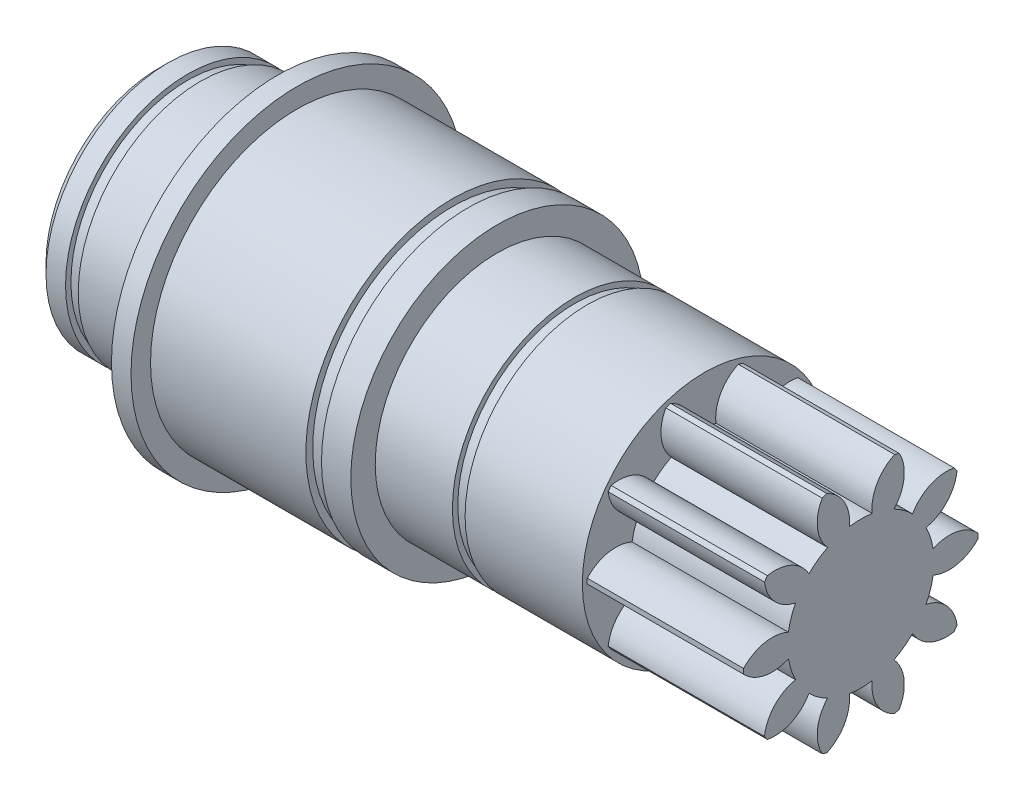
ISO-10303-21;
HEADER;
FILE_DESCRIPTION(('STEP AP214'),'2;1');
FILE_NAME('part.step','',(''),(''),'','','');
FILE_SCHEMA(('AUTOMOTIVE_DESIGN { 1 0 10303 214 1 1 1 1 }'));
ENDSEC;
DATA;
#1=APPLICATION_CONTEXT('core data for automotive mechanical design processes');
#2=APPLICATION_PROTOCOL_DEFINITION('international standard','automotive_design',2000,#1);
#3=PRODUCT_CONTEXT('',#1,'mechanical');
#4=PRODUCT('Part','Part','',(#3));
#5=PRODUCT_RELATED_PRODUCT_CATEGORY('part','',(#4));
#6=PRODUCT_DEFINITION_FORMATION('','',#4);
#7=PRODUCT_DEFINITION_CONTEXT('part definition',#1,'design');
#8=PRODUCT_DEFINITION('design','',#6,#7);
#9=PRODUCT_DEFINITION_SHAPE('','',#8);
#10=(LENGTH_UNIT() NAMED_UNIT(*) SI_UNIT(.MILLI.,.METRE.));
#11=(NAMED_UNIT(*) PLANE_ANGLE_UNIT() SI_UNIT($,.RADIAN.));
#12=(NAMED_UNIT(*) SI_UNIT($,.STERADIAN.) SOLID_ANGLE_UNIT());
#13=UNCERTAINTY_MEASURE_WITH_UNIT(LENGTH_MEASURE(1.E-05),#10,'distance_accuracy_value','');
#14=(GEOMETRIC_REPRESENTATION_CONTEXT(3) GLOBAL_UNCERTAINTY_ASSIGNED_CONTEXT((#13)) GLOBAL_UNIT_ASSIGNED_CONTEXT((#10,
#11,#12)) REPRESENTATION_CONTEXT('',''));
#15=CARTESIAN_POINT('',(0.,0.,0.));
#16=DIRECTION('',(0.,0.,1.));
#17=DIRECTION('',(1.,0.,0.));
#18=AXIS2_PLACEMENT_3D('',#15,#16,#17);
#19=CARTESIAN_POINT('',(-51.6,0.,0.));
#20=DIRECTION('',(-1.,0.,0.));
#21=DIRECTION('',(0.,0.,1.00000000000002));
#22=AXIS2_PLACEMENT_3D('',#19,#20,#21);
#23=PLANE('',#22);
#24=CARTESIAN_POINT('',(-51.6,0.,0.));
#25=DIRECTION('',(-1.,0.,0.));
#26=DIRECTION('',(0.,0.,1.00000000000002));
#27=AXIS2_PLACEMENT_3D('',#24,#25,#26);
#28=CIRCLE('',#27,12.5);
#29=CARTESIAN_POINT('',(-51.6,0.,12.5000000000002));
#30=VERTEX_POINT('',#29);
#31=EDGE_CURVE('E379',#30,#30,#28,.T.);
#32=ORIENTED_EDGE('',*,*,#31,.T.);
#33=EDGE_LOOP('',(#32));
#34=FACE_BOUND('',#33,.T.);
#35=CARTESIAN_POINT('',(-51.6,0.,0.));
#36=DIRECTION('',(-1.,0.,0.));
#37=DIRECTION('',(0.,0.,1.00000000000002));
#38=AXIS2_PLACEMENT_3D('',#35,#36,#37);
#39=CIRCLE('',#38,11.95);
#40=CARTESIAN_POINT('',(-51.6,0.,11.9500000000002));
#41=VERTEX_POINT('',#40);
#42=EDGE_CURVE('E370',#41,#41,#39,.T.);
#43=ORIENTED_EDGE('',*,*,#42,.F.);
#44=EDGE_LOOP('',(#43));
#45=FACE_BOUND('',#44,.T.);
#46=ADVANCED_FACE('F46',(#34,#45),#23,.T.);
#47=CARTESIAN_POINT('',(-43.7,0.,0.));
#48=DIRECTION('',(-1.,0.,0.));
#49=DIRECTION('',(0.,0.,1.00000000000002));
#50=AXIS2_PLACEMENT_3D('',#47,#48,#49);
#51=PLANE('',#50);
#52=CARTESIAN_POINT('',(-43.7,0.,0.));
#53=DIRECTION('',(-1.,0.,0.));
#54=DIRECTION('',(0.,0.,1.00000000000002));
#55=AXIS2_PLACEMENT_3D('',#52,#53,#54);
#56=CIRCLE('',#55,17.);
#57=CARTESIAN_POINT('',(-43.7,0.,17.0000000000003));
#58=VERTEX_POINT('',#57);
#59=EDGE_CURVE('E385',#58,#58,#56,.T.);
#60=ORIENTED_EDGE('',*,*,#59,.T.);
#61=EDGE_LOOP('',(#60));
#62=FACE_BOUND('',#61,.T.);
#63=CARTESIAN_POINT('',(-43.7,0.,0.));
#64=DIRECTION('',(-1.,0.,0.));
#65=DIRECTION('',(0.,0.,1.00000000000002));
#66=AXIS2_PLACEMENT_3D('',#63,#64,#65);
#67=CIRCLE('',#66,12.5);
#68=CARTESIAN_POINT('',(-43.7,0.,12.5000000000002));
#69=VERTEX_POINT('',#68);
#70=EDGE_CURVE('E376',#69,#69,#67,.T.);
#71=ORIENTED_EDGE('',*,*,#70,.F.);
#72=EDGE_LOOP('',(#71));
#73=FACE_BOUND('',#72,.T.);
#74=ADVANCED_FACE('F702',(#62,#73),#51,.T.);
#75=CARTESIAN_POINT('',(-24.2,0.,0.));
#76=DIRECTION('',(-1.,0.,0.));
#77=DIRECTION('',(0.,0.,1.00000000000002));
#78=AXIS2_PLACEMENT_3D('',#75,#76,#77);
#79=PLANE('',#78);
#80=CARTESIAN_POINT('',(-24.2,0.,0.));
#81=DIRECTION('',(-1.,0.,0.));
#82=DIRECTION('',(0.,0.,1.00000000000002));
#83=AXIS2_PLACEMENT_3D('',#80,#81,#82);
#84=CIRCLE('',#83,15.);
#85=CARTESIAN_POINT('',(-24.2,0.,15.0000000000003));
#86=VERTEX_POINT('',#85);
#87=EDGE_CURVE('E403',#86,#86,#84,.T.);
#88=ORIENTED_EDGE('',*,*,#87,.T.);
#89=EDGE_LOOP('',(#88));
#90=FACE_BOUND('',#89,.T.);
#91=CARTESIAN_POINT('',(-24.2,0.,0.));
#92=DIRECTION('',(-1.,0.,0.));
#93=DIRECTION('',(0.,0.,1.00000000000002));
#94=AXIS2_PLACEMENT_3D('',#91,#92,#93);
#95=CIRCLE('',#94,14.3);
#96=CARTESIAN_POINT('',(-24.2,0.,14.3000000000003));
#97=VERTEX_POINT('',#96);
#98=EDGE_CURVE('E394',#97,#97,#95,.T.);
#99=ORIENTED_EDGE('',*,*,#98,.F.);
#100=EDGE_LOOP('',(#99));
#101=FACE_BOUND('',#100,.T.);
#102=ADVANCED_FACE('F708',(#90,#101),#79,.T.);
#103=CARTESIAN_POINT('',(-12.,-1.60114976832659E-12,4.9960036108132E-13));
#104=DIRECTION('',(-1.,0.,0.));
#105=DIRECTION('',(0.,0.,1.00000000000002));
#106=AXIS2_PLACEMENT_3D('',#103,#104,#105);
#107=PLANE('',#106);
#108=CARTESIAN_POINT('',(-12.,-1.60114976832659E-12,4.9960036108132E-13));
#109=DIRECTION('',(-1.,0.,0.));
#110=DIRECTION('',(0.,0.,1.00000000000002));
#111=AXIS2_PLACEMENT_3D('',#108,#109,#110);
#112=CIRCLE('',#111,12.5);
#113=CARTESIAN_POINT('',(-12.,-1.60878255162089E-12,12.5000000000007));
#114=VERTEX_POINT('',#113);
#115=EDGE_CURVE('E421',#114,#114,#112,.T.);
#116=ORIENTED_EDGE('',*,*,#115,.T.);
#117=EDGE_LOOP('',(#116));
#118=FACE_BOUND('',#117,.T.);
#119=CARTESIAN_POINT('',(-12.,-1.60114976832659E-12,4.9960036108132E-13));
#120=DIRECTION('',(-1.,0.,0.));
#121=DIRECTION('',(0.,0.,1.00000000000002));
#122=AXIS2_PLACEMENT_3D('',#119,#120,#121);
#123=CIRCLE('',#122,11.95);
#124=CARTESIAN_POINT('',(-12.,-1.60844670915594E-12,11.9500000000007));
#125=VERTEX_POINT('',#124);
#126=EDGE_CURVE('E412',#125,#125,#123,.T.);
#127=ORIENTED_EDGE('',*,*,#126,.F.);
#128=EDGE_LOOP('',(#127));
#129=FACE_BOUND('',#128,.T.);
#130=ADVANCED_FACE('F742',(#118,#129),#107,.T.);
#131=CARTESIAN_POINT('',(16.,-2.01401395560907E-12,0.));
#132=DIRECTION('',(-1.,0.,0.));
#133=DIRECTION('',(0.,0.,1.00000000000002));
#134=AXIS2_PLACEMENT_3D('',#131,#132,#133);
#135=PLANE('',#134);
#136=CARTESIAN_POINT('',(15.9999999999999,2.46642274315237,9.06746828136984));
#137=DIRECTION('',(-1.,0.,0.));
#138=DIRECTION('',(0.,0.951056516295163,0.309016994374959));
#139=AXIS2_PLACEMENT_3D('',#136,#137,#138);
#140=CIRCLE('',#139,4.);
#141=CARTESIAN_POINT('',(15.9999999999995,-1.17254140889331,7.40676364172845));
#142=VERTEX_POINT('',#141);
#143=CARTESIAN_POINT('',(15.9999999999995,-0.256880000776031,11.9972502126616));
#144=VERTEX_POINT('',#143);
#145=EDGE_CURVE('E557',#142,#144,#140,.T.);
#146=ORIENTED_EDGE('',*,*,#145,.F.);
#147=CARTESIAN_POINT('',(16.,-2.01401395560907E-12,0.));
#148=DIRECTION('',(-1.,0.,0.));
#149=DIRECTION('',(0.,0.951056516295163,0.309016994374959));
#150=AXIS2_PLACEMENT_3D('',#147,#148,#149);
#151=CIRCLE('',#150,7.499);
#152=CARTESIAN_POINT('',(16.,-3.40498050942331,6.68140020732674));
#153=VERTEX_POINT('',#152);
#154=EDGE_CURVE('E561',#153,#142,#151,.T.);
#155=ORIENTED_EDGE('',*,*,#154,.F.);
#156=CARTESIAN_POINT('',(16.,-7.32510204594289,5.88600902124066));
#157=DIRECTION('',(-1.,0.,0.));
#158=DIRECTION('',(0.,0.951056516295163,0.309016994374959));
#159=AXIS2_PLACEMENT_3D('',#156,#157,#158);
#160=CIRCLE('',#159,4.);
#161=CARTESIAN_POINT('',(15.9999999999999,-6.84398645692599,9.85696958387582));
#162=VERTEX_POINT('',#161);
#163=EDGE_CURVE('E559',#162,#153,#160,.T.);
#164=ORIENTED_EDGE('',*,*,#163,.F.);
#165=CARTESIAN_POINT('',(16.,-2.01401395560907E-12,0.));
#166=DIRECTION('',(-1.,0.,0.));
#167=DIRECTION('',(0.,0.,1.00000000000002));
#168=AXIS2_PLACEMENT_3D('',#165,#166,#167);
#169=CIRCLE('',#168,12.);
#170=CARTESIAN_POINT('',(16.,-7.25962702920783,9.55498903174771));
#171=VERTEX_POINT('',#170);
#172=EDGE_CURVE('E935',#171,#162,#169,.T.);
#173=ORIENTED_EDGE('',*,*,#172,.F.);
#174=CARTESIAN_POINT('',(15.9999999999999,-3.33434621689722,8.78546284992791));
#175=DIRECTION('',(-1.,0.,0.));
#176=DIRECTION('',(0.,0.587785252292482,0.809016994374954));
#177=AXIS2_PLACEMENT_3D('',#174,#175,#176);
#178=CIRCLE('',#177,4.);
#179=CARTESIAN_POINT('',(16.,-5.30219236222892,5.30299511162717));
#180=VERTEX_POINT('',#179);
#181=EDGE_CURVE('E535',#180,#171,#178,.T.);
#182=ORIENTED_EDGE('',*,*,#181,.F.);
#183=CARTESIAN_POINT('',(16.,-2.01401395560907E-12,0.));
#184=DIRECTION('',(-1.,0.,0.));
#185=DIRECTION('',(0.,0.587785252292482,0.809016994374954));
#186=AXIS2_PLACEMENT_3D('',#183,#184,#185);
#187=CIRCLE('',#186,7.499);
#188=CARTESIAN_POINT('',(16.,-6.68191560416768,3.40396898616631));
#189=VERTEX_POINT('',#188);
#190=EDGE_CURVE('E539',#189,#180,#187,.T.);
#191=ORIENTED_EDGE('',*,*,#190,.F.);
#192=CARTESIAN_POINT('',(16.,-9.38584133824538,0.456294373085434));
#193=DIRECTION('',(-1.,0.,0.));
#194=DIRECTION('',(0.,0.587785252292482,0.809016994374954));
#195=AXIS2_PLACEMENT_3D('',#192,#193,#194);
#196=CIRCLE('',#195,4.);
#197=CARTESIAN_POINT('',(16.,-11.3306827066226,3.95166160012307));
#198=VERTEX_POINT('',#197);
#199=EDGE_CURVE('E537',#198,#189,#196,.T.);
#200=ORIENTED_EDGE('',*,*,#199,.F.);
#201=CARTESIAN_POINT('',(16.,-11.489443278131,3.46304680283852));
#202=VERTEX_POINT('',#201);
#203=EDGE_CURVE('E930',#202,#198,#169,.T.);
#204=ORIENTED_EDGE('',*,*,#203,.F.);
#205=CARTESIAN_POINT('',(16.,-7.86150825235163,5.14770921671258));
#206=DIRECTION('',(-1.,0.,0.));
#207=DIRECTION('',(0.,0.,1.00000000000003));
#208=AXIS2_PLACEMENT_3D('',#205,#206,#207);
#209=CIRCLE('',#208,4.);
#210=CARTESIAN_POINT('',(16.,-7.4065860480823,1.17366269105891));
#211=VERTEX_POINT('',#210);
#212=EDGE_CURVE('E513',#211,#202,#209,.T.);
#213=ORIENTED_EDGE('',*,*,#212,.F.);
#214=CARTESIAN_POINT('',(16.,-2.01401395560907E-12,0.));
#215=DIRECTION('',(-1.,0.,0.));
#216=DIRECTION('',(0.,0.,1.00000000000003));
#217=AXIS2_PLACEMENT_3D('',#214,#215,#216);
#218=CIRCLE('',#217,7.499);
#219=CARTESIAN_POINT('',(16.,-7.40658604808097,-1.17366269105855));
#220=VERTEX_POINT('',#219);
#221=EDGE_CURVE('E517',#220,#211,#218,.T.);
#222=ORIENTED_EDGE('',*,*,#221,.F.);
#223=CARTESIAN_POINT('',(16.,-7.86150825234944,-5.14770921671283));
#224=DIRECTION('',(-1.,0.,0.));
#225=DIRECTION('',(0.,0.,1.00000000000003));
#226=AXIS2_PLACEMENT_3D('',#223,#224,#225);
#227=CIRCLE('',#226,4.);
#228=CARTESIAN_POINT('',(16.,-11.4894432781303,-3.46304680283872));
#229=VERTEX_POINT('',#228);
#230=EDGE_CURVE('E515',#229,#220,#227,.T.);
#231=ORIENTED_EDGE('',*,*,#230,.F.);
#232=CARTESIAN_POINT('',(16.,-11.3306827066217,-3.9516616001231));
#233=VERTEX_POINT('',#232);
#234=EDGE_CURVE('E925',#233,#229,#169,.T.);
#235=ORIENTED_EDGE('',*,*,#234,.F.);
#236=CARTESIAN_POINT('',(16.,-9.38584133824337,-0.456294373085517));
#237=DIRECTION('',(-1.,0.,0.));
#238=DIRECTION('',(0.,-0.587785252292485,0.80901699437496));
#239=AXIS2_PLACEMENT_3D('',#236,#237,#238);
#240=CIRCLE('',#239,4.);
#241=CARTESIAN_POINT('',(16.,-6.68191560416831,-3.40396898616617));
#242=VERTEX_POINT('',#241);
#243=EDGE_CURVE('E491',#242,#233,#240,.T.);
#244=ORIENTED_EDGE('',*,*,#243,.F.);
#245=CARTESIAN_POINT('',(16.,-2.01401395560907E-12,0.));
#246=DIRECTION('',(-1.,0.,0.));
#247=DIRECTION('',(0.,-0.587785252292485,0.80901699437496));
#248=AXIS2_PLACEMENT_3D('',#245,#246,#247);
#249=CIRCLE('',#248,7.499);
#250=CARTESIAN_POINT('',(16.,-5.30219236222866,-5.30299511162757));
#251=VERTEX_POINT('',#250);
#252=EDGE_CURVE('E495',#251,#242,#249,.T.);
#253=ORIENTED_EDGE('',*,*,#252,.F.);
#254=CARTESIAN_POINT('',(15.9999999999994,-3.3343462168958,-8.7854628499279));
#255=DIRECTION('',(-1.,0.,0.));
#256=DIRECTION('',(0.,-0.587785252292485,0.80901699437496));
#257=AXIS2_PLACEMENT_3D('',#254,#255,#256);
#258=CIRCLE('',#257,4.);
#259=CARTESIAN_POINT('',(16.,-7.25962702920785,-9.5549890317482));
#260=VERTEX_POINT('',#259);
#261=EDGE_CURVE('E493',#260,#251,#258,.T.);
#262=ORIENTED_EDGE('',*,*,#261,.F.);
#263=CARTESIAN_POINT('',(16.,-6.84398645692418,-9.85696958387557));
#264=VERTEX_POINT('',#263);
#265=EDGE_CURVE('E920',#264,#260,#169,.T.);
#266=ORIENTED_EDGE('',*,*,#265,.F.);
#267=CARTESIAN_POINT('',(16.,-7.32510204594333,-5.88600902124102));
#268=DIRECTION('',(-1.,0.,0.));
#269=DIRECTION('',(0.,-0.951056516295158,0.309016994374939));
#270=AXIS2_PLACEMENT_3D('',#267,#268,#269);
#271=CIRCLE('',#270,4.);
#272=CARTESIAN_POINT('',(16.,-3.40498050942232,-6.68140020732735));
#273=VERTEX_POINT('',#272);
#274=EDGE_CURVE('E469',#273,#264,#271,.T.);
#275=ORIENTED_EDGE('',*,*,#274,.F.);
#276=CARTESIAN_POINT('',(16.,-2.01401395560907E-12,0.));
#277=DIRECTION('',(-1.,0.,0.));
#278=DIRECTION('',(0.,-0.951056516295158,0.309016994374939));
#279=AXIS2_PLACEMENT_3D('',#276,#277,#278);
#280=CIRCLE('',#279,7.499);
#281=CARTESIAN_POINT('',(16.,-1.17254140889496,-7.40676364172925));
#282=VERTEX_POINT('',#281);
#283=EDGE_CURVE('E473',#282,#273,#280,.T.);
#284=ORIENTED_EDGE('',*,*,#283,.F.);
#285=CARTESIAN_POINT('',(15.9999999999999,2.46642274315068,-9.06746828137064));
#286=DIRECTION('',(-1.,0.,0.));
#287=DIRECTION('',(0.,-0.951056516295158,0.309016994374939));
#288=AXIS2_PLACEMENT_3D('',#285,#286,#287);
#289=CIRCLE('',#288,4.);
#290=CARTESIAN_POINT('',(16.,-0.256880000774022,-11.9972502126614));
#291=VERTEX_POINT('',#290);
#292=EDGE_CURVE('E471',#291,#282,#289,.T.);
#293=ORIENTED_EDGE('',*,*,#292,.F.);
#294=CARTESIAN_POINT('',(16.,0.256880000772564,-11.9972502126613));
#295=VERTEX_POINT('',#294);
#296=EDGE_CURVE('E919',#295,#291,#169,.T.);
#297=ORIENTED_EDGE('',*,*,#296,.F.);
#298=CARTESIAN_POINT('',(16.,-2.46642274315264,-9.0674682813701));
#299=DIRECTION('',(-1.,0.,0.));
#300=DIRECTION('',(0.,-0.951056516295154,-0.30901699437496));
#301=AXIS2_PLACEMENT_3D('',#298,#299,#300);
#302=CIRCLE('',#301,4.);
#303=CARTESIAN_POINT('',(15.9999999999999,1.17254140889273,-7.40676364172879));
#304=VERTEX_POINT('',#303);
#305=EDGE_CURVE('E448',#304,#295,#302,.T.);
#306=ORIENTED_EDGE('',*,*,#305,.F.);
#307=CARTESIAN_POINT('',(16.,-2.01401395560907E-12,0.));
#308=DIRECTION('',(-1.,0.,0.));
#309=DIRECTION('',(0.,-0.951056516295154,-0.30901699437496));
#310=AXIS2_PLACEMENT_3D('',#307,#308,#309);
#311=CIRCLE('',#310,7.499);
#312=CARTESIAN_POINT('',(15.9999999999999,3.40498050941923,-6.68140020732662));
#313=VERTEX_POINT('',#312);
#314=EDGE_CURVE('E452',#313,#304,#311,.T.);
#315=ORIENTED_EDGE('',*,*,#314,.F.);
#316=CARTESIAN_POINT('',(16.,7.32510204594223,-5.88600902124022));
#317=DIRECTION('',(-1.,0.,0.));
#318=DIRECTION('',(0.,-0.951056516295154,-0.30901699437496));
#319=AXIS2_PLACEMENT_3D('',#316,#317,#318);
#320=CIRCLE('',#319,4.);
#321=CARTESIAN_POINT('',(15.9999999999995,6.84398645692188,-9.8569695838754));
#322=VERTEX_POINT('',#321);
#323=EDGE_CURVE('E450',#322,#313,#320,.T.);
#324=ORIENTED_EDGE('',*,*,#323,.F.);
#325=CARTESIAN_POINT('',(15.9999999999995,7.25962702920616,-9.55498903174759));
#326=VERTEX_POINT('',#325);
#327=EDGE_CURVE('E649',#326,#322,#169,.T.);
#328=ORIENTED_EDGE('',*,*,#327,.F.);
#329=CARTESIAN_POINT('',(16.,3.33434621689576,-8.78546284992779));
#330=DIRECTION('',(-1.,0.,0.));
#331=DIRECTION('',(0.,-0.587785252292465,-0.809016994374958));
#332=AXIS2_PLACEMENT_3D('',#329,#330,#331);
#333=CIRCLE('',#332,4.);
#334=CARTESIAN_POINT('',(15.9999999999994,5.30219236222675,-5.30299511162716));
#335=VERTEX_POINT('',#334);
#336=EDGE_CURVE('E430',#335,#326,#333,.T.);
#337=ORIENTED_EDGE('',*,*,#336,.F.);
#338=CARTESIAN_POINT('',(16.,-2.01401395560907E-12,0.));
#339=DIRECTION('',(-1.,0.,0.));
#340=DIRECTION('',(0.,-0.587785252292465,-0.809016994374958));
#341=AXIS2_PLACEMENT_3D('',#338,#339,#340);
#342=CIRCLE('',#341,7.499);
#343=CARTESIAN_POINT('',(15.9999999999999,6.68191560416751,-3.40396898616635));
#344=VERTEX_POINT('',#343);
#345=EDGE_CURVE('E434',#344,#335,#342,.T.);
#346=ORIENTED_EDGE('',*,*,#345,.F.);
#347=CARTESIAN_POINT('',(15.9999999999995,9.38584133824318,-0.456294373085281));
#348=DIRECTION('',(-1.,0.,0.));
#349=DIRECTION('',(0.,-0.587785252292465,-0.809016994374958));
#350=AXIS2_PLACEMENT_3D('',#347,#348,#349);
#351=CIRCLE('',#350,4.);
#352=CARTESIAN_POINT('',(16.,11.3306827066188,-3.95166160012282));
#353=VERTEX_POINT('',#352);
#354=EDGE_CURVE('E432',#353,#344,#351,.T.);
#355=ORIENTED_EDGE('',*,*,#354,.F.);
#356=CARTESIAN_POINT('',(16.,11.4894432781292,-3.4630468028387));
#357=VERTEX_POINT('',#356);
#358=EDGE_CURVE('E645',#357,#353,#169,.T.);
#359=ORIENTED_EDGE('',*,*,#358,.F.);
#360=CARTESIAN_POINT('',(15.9999999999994,7.86150825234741,-5.14770921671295));
#361=DIRECTION('',(-1.,0.,0.));
#362=DIRECTION('',(0.,0.,-1.00000000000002));
#363=AXIS2_PLACEMENT_3D('',#360,#361,#362);
#364=CIRCLE('',#363,4.);
#365=CARTESIAN_POINT('',(16.,7.40658604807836,-1.17366269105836));
#366=VERTEX_POINT('',#365);
#367=EDGE_CURVE('E623',#366,#357,#364,.T.);
#368=ORIENTED_EDGE('',*,*,#367,.F.);
#369=CARTESIAN_POINT('',(16.,-2.01401395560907E-12,0.));
#370=DIRECTION('',(-1.,0.,0.));
#371=DIRECTION('',(0.,0.,-1.00000000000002));
#372=AXIS2_PLACEMENT_3D('',#369,#370,#371);
#373=CIRCLE('',#372,7.499);
#374=CARTESIAN_POINT('',(16.,7.40658604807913,1.1736626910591));
#375=VERTEX_POINT('',#374);
#376=EDGE_CURVE('E627',#375,#366,#373,.T.);
#377=ORIENTED_EDGE('',*,*,#376,.F.);
#378=CARTESIAN_POINT('',(16.,7.86150825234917,5.14770921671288));
#379=DIRECTION('',(-1.,0.,0.));
#380=DIRECTION('',(0.,0.,-1.00000000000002));
#381=AXIS2_PLACEMENT_3D('',#378,#379,#380);
#382=CIRCLE('',#381,4.);
#383=CARTESIAN_POINT('',(16.,11.4894432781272,3.46304680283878));
#384=VERTEX_POINT('',#383);
#385=EDGE_CURVE('E625',#384,#375,#382,.T.);
#386=ORIENTED_EDGE('',*,*,#385,.F.);
#387=CARTESIAN_POINT('',(15.9999999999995,11.330682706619,3.95166160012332));
#388=VERTEX_POINT('',#387);
#389=EDGE_CURVE('E643',#388,#384,#169,.T.);
#390=ORIENTED_EDGE('',*,*,#389,.F.);
#391=CARTESIAN_POINT('',(15.9999999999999,9.38584133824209,0.456294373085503));
#392=DIRECTION('',(-1.,0.,0.));
#393=DIRECTION('',(0.,0.587785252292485,-0.809016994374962));
#394=AXIS2_PLACEMENT_3D('',#391,#392,#393);
#395=CIRCLE('',#394,4.);
#396=CARTESIAN_POINT('',(16.,6.68191560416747,3.40396898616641));
#397=VERTEX_POINT('',#396);
#398=EDGE_CURVE('E601',#397,#388,#395,.T.);
#399=ORIENTED_EDGE('',*,*,#398,.F.);
#400=CARTESIAN_POINT('',(16.,-2.01401395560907E-12,0.));
#401=DIRECTION('',(-1.,0.,0.));
#402=DIRECTION('',(0.,0.587785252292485,-0.809016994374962));
#403=AXIS2_PLACEMENT_3D('',#400,#401,#402);
#404=CIRCLE('',#403,7.499);
#405=CARTESIAN_POINT('',(15.9999999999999,5.30219236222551,5.30299511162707));
#406=VERTEX_POINT('',#405);
#407=EDGE_CURVE('E605',#406,#397,#404,.T.);
#408=ORIENTED_EDGE('',*,*,#407,.F.);
#409=CARTESIAN_POINT('',(16.,3.33434621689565,8.78546284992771));
#410=DIRECTION('',(-1.,0.,0.));
#411=DIRECTION('',(0.,0.587785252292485,-0.809016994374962));
#412=AXIS2_PLACEMENT_3D('',#409,#410,#411);
#413=CIRCLE('',#412,4.);
#414=CARTESIAN_POINT('',(16.,7.25962702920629,9.55498903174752));
#415=VERTEX_POINT('',#414);
#416=EDGE_CURVE('E603',#415,#406,#413,.T.);
#417=ORIENTED_EDGE('',*,*,#416,.F.);
#418=CARTESIAN_POINT('',(16.,6.84398645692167,9.85696958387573));
#419=VERTEX_POINT('',#418);
#420=EDGE_CURVE('E945',#419,#415,#169,.T.);
#421=ORIENTED_EDGE('',*,*,#420,.F.);
#422=CARTESIAN_POINT('',(15.9999999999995,7.32510204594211,5.88600902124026));
#423=DIRECTION('',(-1.,0.,0.));
#424=DIRECTION('',(0.,0.951056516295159,-0.309016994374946));
#425=AXIS2_PLACEMENT_3D('',#422,#423,#424);
#426=CIRCLE('',#425,4.);
#427=CARTESIAN_POINT('',(16.,3.40498050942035,6.68140020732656));
#428=VERTEX_POINT('',#427);
#429=EDGE_CURVE('E579',#428,#419,#426,.T.);
#430=ORIENTED_EDGE('',*,*,#429,.F.);
#431=CARTESIAN_POINT('',(16.,-2.01401395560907E-12,0.));
#432=DIRECTION('',(-1.,0.,0.));
#433=DIRECTION('',(0.,0.951056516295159,-0.309016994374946));
#434=AXIS2_PLACEMENT_3D('',#431,#432,#433);
#435=CIRCLE('',#434,7.499);
#436=CARTESIAN_POINT('',(15.9999999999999,1.17254140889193,7.40676364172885));
#437=VERTEX_POINT('',#436);
#438=EDGE_CURVE('E583',#437,#428,#435,.T.);
#439=ORIENTED_EDGE('',*,*,#438,.F.);
#440=CARTESIAN_POINT('',(16.,-2.46642274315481,9.06746828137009));
#441=DIRECTION('',(-1.,0.,0.));
#442=DIRECTION('',(0.,0.951056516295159,-0.309016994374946));
#443=AXIS2_PLACEMENT_3D('',#440,#441,#442);
#444=CIRCLE('',#443,4.);
#445=CARTESIAN_POINT('',(15.9999999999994,0.256880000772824,11.9972502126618));
#446=VERTEX_POINT('',#445);
#447=EDGE_CURVE('E581',#446,#437,#444,.T.);
#448=ORIENTED_EDGE('',*,*,#447,.F.);
#449=EDGE_CURVE('E940',#144,#446,#169,.T.);
#450=ORIENTED_EDGE('',*,*,#449,.F.);
#451=EDGE_LOOP('',(#146,#155,#164,#173,#182,#191,#200,#204,#213,#222,#231,#235,#244,#253,#262,
#266,#275,#284,#293,#297,#306,#315,#324,#328,#337,#346,#355,#359,#368,#377,#386,#390,#399,#408,
#417,#421,#430,#439,#448,#450));
#452=FACE_BOUND('',#451,.T.);
#453=ADVANCED_FACE('F48',(#452),#135,.F.);
#454=CARTESIAN_POINT('',(-10.,-2.03136119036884E-12,-1.38777878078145E-13));
#455=DIRECTION('',(-1.,0.,0.));
#456=DIRECTION('',(0.,0.,1.00000000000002));
#457=AXIS2_PLACEMENT_3D('',#454,#455,#456);
#458=CYLINDRICAL_SURFACE('',#457,12.);
#459=DIRECTION('',(-1.,0.,0.));
#460=VECTOR('',#459,1.);
#461=CARTESIAN_POINT('',(7.99999999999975,7.25962702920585,-9.55498903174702));
#462=LINE('',#461,#460);
#463=CARTESIAN_POINT('',(-2.81025203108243E-13,7.25962702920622,-9.55498903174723));
#464=VERTEX_POINT('',#463);
#465=EDGE_CURVE('E442',#326,#464,#462,.T.);
#466=ORIENTED_EDGE('',*,*,#465,.F.);
#467=ORIENTED_EDGE('',*,*,#327,.T.);
#468=DIRECTION('',(-1.,0.,0.));
#469=VECTOR('',#468,1.);
#470=CARTESIAN_POINT('',(7.99999999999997,6.8439864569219,-9.85696958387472));
#471=LINE('',#470,#469);
#472=CARTESIAN_POINT('',(-2.81025203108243E-13,6.84398645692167,-9.85696958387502));
#473=VERTEX_POINT('',#472);
#474=EDGE_CURVE('E458',#473,#322,#471,.F.);
#475=ORIENTED_EDGE('',*,*,#474,.F.);
#476=CARTESIAN_POINT('',(-2.81025203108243E-13,-1.80584713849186E-12,0.));
#477=DIRECTION('',(-1.,0.,0.));
#478=DIRECTION('',(0.,0.,1.00000000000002));
#479=AXIS2_PLACEMENT_3D('',#476,#477,#478);
#480=CIRCLE('',#479,12.);
#481=EDGE_CURVE('E644',#464,#473,#480,.T.);
#482=ORIENTED_EDGE('',*,*,#481,.F.);
#483=EDGE_LOOP('',(#466,#467,#475,#482));
#484=FACE_BOUND('',#483,.T.);
#485=ADVANCED_FACE('F891',(#484),#458,.T.);
#486=DIRECTION('',(-1.,0.,0.));
#487=VECTOR('',#486,1.);
#488=CARTESIAN_POINT('',(8.,11.3306827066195,-3.95166160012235));
#489=LINE('',#488,#487);
#490=CARTESIAN_POINT('',(0.,11.3306827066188,-3.95166160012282));
#491=VERTEX_POINT('',#490);
#492=EDGE_CURVE('E440',#491,#353,#489,.F.);
#493=ORIENTED_EDGE('',*,*,#492,.F.);
#494=CARTESIAN_POINT('',(-2.81025203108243E-13,11.4894432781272,-3.46304680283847));
#495=VERTEX_POINT('',#494);
#496=EDGE_CURVE('E640',#495,#491,#480,.T.);
#497=ORIENTED_EDGE('',*,*,#496,.F.);
#498=DIRECTION('',(-1.,0.,0.));
#499=VECTOR('',#498,1.);
#500=CARTESIAN_POINT('',(7.99999999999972,11.4894432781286,-3.46304680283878));
#501=LINE('',#500,#499);
#502=EDGE_CURVE('E637',#357,#495,#501,.T.);
#503=ORIENTED_EDGE('',*,*,#502,.F.);
#504=ORIENTED_EDGE('',*,*,#358,.T.);
#505=EDGE_LOOP('',(#493,#497,#503,#504));
#506=FACE_BOUND('',#505,.T.);
#507=ADVANCED_FACE('F899',(#506),#458,.T.);
#508=DIRECTION('',(-1.,0.,0.));
#509=VECTOR('',#508,1.);
#510=CARTESIAN_POINT('',(7.99999999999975,0.256880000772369,-11.9972502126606));
#511=LINE('',#510,#509);
#512=CARTESIAN_POINT('',(-2.4980018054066E-13,0.25688000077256,-11.9972502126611));
#513=VERTEX_POINT('',#512);
#514=EDGE_CURVE('E461',#295,#513,#511,.T.);
#515=ORIENTED_EDGE('',*,*,#514,.F.);
#516=ORIENTED_EDGE('',*,*,#296,.T.);
#517=DIRECTION('',(-1.,0.,0.));
#518=VECTOR('',#517,1.);
#519=CARTESIAN_POINT('',(7.99999999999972,-0.256880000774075,-11.9972502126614));
#520=LINE('',#519,#518);
#521=CARTESIAN_POINT('',(-2.81025203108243E-13,-0.256880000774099,-11.9972502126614));
#522=VERTEX_POINT('',#521);
#523=EDGE_CURVE('E480',#522,#291,#520,.F.);
#524=ORIENTED_EDGE('',*,*,#523,.F.);
#525=EDGE_CURVE('E992',#513,#522,#480,.T.);
#526=ORIENTED_EDGE('',*,*,#525,.F.);
#527=EDGE_LOOP('',(#515,#516,#524,#526));
#528=FACE_BOUND('',#527,.T.);
#529=ADVANCED_FACE('F905',(#528),#458,.T.);
#530=DIRECTION('',(-1.,0.,0.));
#531=VECTOR('',#530,1.);
#532=CARTESIAN_POINT('',(7.99999999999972,-6.84398645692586,-9.85696958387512));
#533=LINE('',#532,#531);
#534=CARTESIAN_POINT('',(-2.81025203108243E-13,-6.84398645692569,-9.8569695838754));
#535=VERTEX_POINT('',#534);
#536=EDGE_CURVE('E483',#264,#535,#533,.T.);
#537=ORIENTED_EDGE('',*,*,#536,.F.);
#538=ORIENTED_EDGE('',*,*,#265,.T.);
#539=DIRECTION('',(-1.,0.,0.));
#540=VECTOR('',#539,1.);
#541=CARTESIAN_POINT('',(7.99999999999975,-7.25962702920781,-9.55498903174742));
#542=LINE('',#541,#540);
#543=CARTESIAN_POINT('',(-2.4980018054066E-13,-7.25962702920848,-9.55498903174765));
#544=VERTEX_POINT('',#543);
#545=EDGE_CURVE('E502',#544,#260,#542,.F.);
#546=ORIENTED_EDGE('',*,*,#545,.F.);
#547=EDGE_CURVE('E988',#535,#544,#480,.T.);
#548=ORIENTED_EDGE('',*,*,#547,.F.);
#549=EDGE_LOOP('',(#537,#538,#546,#548));
#550=FACE_BOUND('',#549,.T.);
#551=ADVANCED_FACE('F1014',(#550),#458,.T.);
#552=DIRECTION('',(-1.,0.,0.));
#553=VECTOR('',#552,1.);
#554=CARTESIAN_POINT('',(7.99999999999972,-11.3306827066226,-3.95166160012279));
#555=LINE('',#554,#553);
#556=CARTESIAN_POINT('',(-2.81025203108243E-13,-11.3306827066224,-3.95166160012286));
#557=VERTEX_POINT('',#556);
#558=EDGE_CURVE('E505',#233,#557,#555,.T.);
#559=ORIENTED_EDGE('',*,*,#558,.F.);
#560=ORIENTED_EDGE('',*,*,#234,.T.);
#561=DIRECTION('',(-1.,0.,0.));
#562=VECTOR('',#561,1.);
#563=CARTESIAN_POINT('',(7.99999999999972,-11.4894432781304,-3.46304680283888));
#564=LINE('',#563,#562);
#565=CARTESIAN_POINT('',(-2.81025203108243E-13,-11.4894432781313,-3.46304680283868));
#566=VERTEX_POINT('',#565);
#567=EDGE_CURVE('E524',#566,#229,#564,.F.);
#568=ORIENTED_EDGE('',*,*,#567,.F.);
#569=EDGE_CURVE('E984',#557,#566,#480,.T.);
#570=ORIENTED_EDGE('',*,*,#569,.F.);
#571=EDGE_LOOP('',(#559,#560,#568,#570));
#572=FACE_BOUND('',#571,.T.);
#573=ADVANCED_FACE('F1018',(#572),#458,.T.);
#574=DIRECTION('',(-1.,0.,0.));
#575=VECTOR('',#574,1.);
#576=CARTESIAN_POINT('',(7.99999999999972,-11.4894432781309,3.46304680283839));
#577=LINE('',#576,#575);
#578=CARTESIAN_POINT('',(-2.81025203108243E-13,-11.4894432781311,3.4630468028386));
#579=VERTEX_POINT('',#578);
#580=EDGE_CURVE('E527',#202,#579,#577,.T.);
#581=ORIENTED_EDGE('',*,*,#580,.F.);
#582=ORIENTED_EDGE('',*,*,#203,.T.);
#583=DIRECTION('',(-1.,0.,0.));
#584=VECTOR('',#583,1.);
#585=CARTESIAN_POINT('',(7.99999999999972,-11.3306827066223,3.9516616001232));
#586=LINE('',#585,#584);
#587=CARTESIAN_POINT('',(-2.81025203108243E-13,-11.3306827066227,3.95166160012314));
#588=VERTEX_POINT('',#587);
#589=EDGE_CURVE('E546',#588,#198,#586,.F.);
#590=ORIENTED_EDGE('',*,*,#589,.F.);
#591=EDGE_CURVE('E980',#579,#588,#480,.T.);
#592=ORIENTED_EDGE('',*,*,#591,.F.);
#593=EDGE_LOOP('',(#581,#582,#590,#592));
#594=FACE_BOUND('',#593,.T.);
#595=ADVANCED_FACE('F1022',(#594),#458,.T.);
#596=DIRECTION('',(-1.,0.,0.));
#597=VECTOR('',#596,1.);
#598=CARTESIAN_POINT('',(7.99999999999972,-7.25962702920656,9.55498903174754));
#599=LINE('',#598,#597);
#600=CARTESIAN_POINT('',(-2.81025203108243E-13,-7.25962702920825,9.55498903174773));
#601=VERTEX_POINT('',#600);
#602=EDGE_CURVE('E549',#171,#601,#599,.T.);
#603=ORIENTED_EDGE('',*,*,#602,.F.);
#604=ORIENTED_EDGE('',*,*,#172,.T.);
#605=DIRECTION('',(-1.,0.,0.));
#606=VECTOR('',#605,1.);
#607=CARTESIAN_POINT('',(7.99999999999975,-6.84398645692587,9.85696958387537));
#608=LINE('',#607,#606);
#609=CARTESIAN_POINT('',(-2.4980018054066E-13,-6.84398645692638,9.8569695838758));
#610=VERTEX_POINT('',#609);
#611=EDGE_CURVE('E568',#610,#162,#608,.F.);
#612=ORIENTED_EDGE('',*,*,#611,.F.);
#613=EDGE_CURVE('E976',#601,#610,#480,.T.);
#614=ORIENTED_EDGE('',*,*,#613,.F.);
#615=EDGE_LOOP('',(#603,#604,#612,#614));
#616=FACE_BOUND('',#615,.T.);
#617=ADVANCED_FACE('F1041',(#616),#458,.T.);
#618=DIRECTION('',(-1.,0.,0.));
#619=VECTOR('',#618,1.);
#620=CARTESIAN_POINT('',(7.99999999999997,-0.256880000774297,11.9972502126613));
#621=LINE('',#620,#619);
#622=CARTESIAN_POINT('',(0.,-0.256880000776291,11.9972502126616));
#623=VERTEX_POINT('',#622);
#624=EDGE_CURVE('E571',#144,#623,#621,.T.);
#625=ORIENTED_EDGE('',*,*,#624,.F.);
#626=ORIENTED_EDGE('',*,*,#449,.T.);
#627=DIRECTION('',(-1.,0.,0.));
#628=VECTOR('',#627,1.);
#629=CARTESIAN_POINT('',(8.,0.256880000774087,11.9972502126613));
#630=LINE('',#629,#628);
#631=CARTESIAN_POINT('',(0.,0.256880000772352,11.9972502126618));
#632=VERTEX_POINT('',#631);
#633=EDGE_CURVE('E590',#632,#446,#630,.F.);
#634=ORIENTED_EDGE('',*,*,#633,.F.);
#635=EDGE_CURVE('E972',#623,#632,#480,.T.);
#636=ORIENTED_EDGE('',*,*,#635,.F.);
#637=EDGE_LOOP('',(#625,#626,#634,#636));
#638=FACE_BOUND('',#637,.T.);
#639=ADVANCED_FACE('F895',(#638),#458,.T.);
#640=DIRECTION('',(-1.,0.,0.));
#641=VECTOR('',#640,1.);
#642=CARTESIAN_POINT('',(7.99999999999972,6.84398645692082,9.8569695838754));
#643=LINE('',#642,#641);
#644=CARTESIAN_POINT('',(-2.81025203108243E-13,6.84398645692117,9.8569695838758));
#645=VERTEX_POINT('',#644);
#646=EDGE_CURVE('E593',#419,#645,#643,.T.);
#647=ORIENTED_EDGE('',*,*,#646,.F.);
#648=ORIENTED_EDGE('',*,*,#420,.T.);
#649=DIRECTION('',(-1.,0.,0.));
#650=VECTOR('',#649,1.);
#651=CARTESIAN_POINT('',(7.99999999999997,7.25962702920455,9.55498903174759));
#652=LINE('',#651,#650);
#653=CARTESIAN_POINT('',(-2.81025203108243E-13,7.25962702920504,9.55498903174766));
#654=VERTEX_POINT('',#653);
#655=EDGE_CURVE('E612',#654,#415,#652,.F.);
#656=ORIENTED_EDGE('',*,*,#655,.F.);
#657=EDGE_CURVE('E970',#645,#654,#480,.T.);
#658=ORIENTED_EDGE('',*,*,#657,.F.);
#659=EDGE_LOOP('',(#647,#648,#656,#658));
#660=FACE_BOUND('',#659,.T.);
#661=ADVANCED_FACE('F889',(#660),#458,.T.);
#662=DIRECTION('',(-1.,0.,0.));
#663=VECTOR('',#662,1.);
#664=CARTESIAN_POINT('',(7.99999999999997,11.3306827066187,3.95166160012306));
#665=LINE('',#664,#663);
#666=CARTESIAN_POINT('',(0.,11.3306827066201,3.95166160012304));
#667=VERTEX_POINT('',#666);
#668=EDGE_CURVE('E615',#388,#667,#665,.T.);
#669=ORIENTED_EDGE('',*,*,#668,.F.);
#670=ORIENTED_EDGE('',*,*,#389,.T.);
#671=DIRECTION('',(-1.,0.,0.));
#672=VECTOR('',#671,1.);
#673=CARTESIAN_POINT('',(7.99999999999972,11.4894432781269,3.46304680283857));
#674=LINE('',#673,#672);
#675=CARTESIAN_POINT('',(-2.81025203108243E-13,11.4894432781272,3.46304680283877));
#676=VERTEX_POINT('',#675);
#677=EDGE_CURVE('E634',#676,#384,#674,.F.);
#678=ORIENTED_EDGE('',*,*,#677,.F.);
#679=EDGE_CURVE('E639',#667,#676,#480,.T.);
#680=ORIENTED_EDGE('',*,*,#679,.F.);
#681=EDGE_LOOP('',(#669,#670,#678,#680));
#682=FACE_BOUND('',#681,.T.);
#683=ADVANCED_FACE('F886',(#682),#458,.T.);
#684=CARTESIAN_POINT('',(15.9999999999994,7.86150825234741,-5.14770921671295));
#685=DIRECTION('',(-1.,0.,0.));
#686=DIRECTION('',(0.,0.,1.00000000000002));
#687=AXIS2_PLACEMENT_3D('',#684,#685,#686);
#688=CYLINDRICAL_SURFACE('',#687,4.);
#689=ORIENTED_EDGE('',*,*,#502,.T.);
#690=CARTESIAN_POINT('',(-2.4980018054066E-13,7.86150825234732,-5.14770921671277));
#691=DIRECTION('',(-1.,0.,0.));
#692=DIRECTION('',(0.,0.,-1.00000000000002));
#693=AXIS2_PLACEMENT_3D('',#690,#691,#692);
#694=CIRCLE('',#693,4.);
#695=CARTESIAN_POINT('',(-2.81025203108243E-13,7.40658604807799,-1.17366269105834));
#696=VERTEX_POINT('',#695);
#697=EDGE_CURVE('E617',#696,#495,#694,.T.);
#698=ORIENTED_EDGE('',*,*,#697,.F.);
#699=DIRECTION('',(-1.,0.,0.));
#700=VECTOR('',#699,1.);
#701=CARTESIAN_POINT('',(16.,7.40658604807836,-1.17366269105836));
#702=LINE('',#701,#700);
#703=EDGE_CURVE('E629',#366,#696,#702,.T.);
#704=ORIENTED_EDGE('',*,*,#703,.F.);
#705=ORIENTED_EDGE('',*,*,#367,.T.);
#706=EDGE_LOOP('',(#689,#698,#704,#705));
#707=FACE_BOUND('',#706,.T.);
#708=ADVANCED_FACE('F883',(#707),#688,.T.);
#709=CARTESIAN_POINT('',(16.,7.86150825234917,5.14770921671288));
#710=DIRECTION('',(-1.,0.,0.));
#711=DIRECTION('',(0.,0.,1.00000000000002));
#712=AXIS2_PLACEMENT_3D('',#709,#710,#711);
#713=CYLINDRICAL_SURFACE('',#712,4.);
#714=ORIENTED_EDGE('',*,*,#677,.T.);
#715=ORIENTED_EDGE('',*,*,#385,.T.);
#716=DIRECTION('',(-1.,0.,0.));
#717=VECTOR('',#716,1.);
#718=CARTESIAN_POINT('',(16.,7.40658604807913,1.1736626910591));
#719=LINE('',#718,#717);
#720=CARTESIAN_POINT('',(-2.81025203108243E-13,7.40658604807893,1.17366269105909));
#721=VERTEX_POINT('',#720);
#722=EDGE_CURVE('E632',#375,#721,#719,.T.);
#723=ORIENTED_EDGE('',*,*,#722,.T.);
#724=CARTESIAN_POINT('',(-2.81025203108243E-13,7.86150825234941,5.14770921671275));
#725=DIRECTION('',(1.,0.,0.));
#726=DIRECTION('',(0.,0.,-1.00000000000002));
#727=AXIS2_PLACEMENT_3D('',#724,#725,#726);
#728=CIRCLE('',#727,4.);
#729=EDGE_CURVE('E648',#721,#676,#728,.T.);
#730=ORIENTED_EDGE('',*,*,#729,.T.);
#731=EDGE_LOOP('',(#714,#715,#723,#730));
#732=FACE_BOUND('',#731,.T.);
#733=ADVANCED_FACE('F879',(#732),#713,.T.);
#734=CARTESIAN_POINT('',(16.,-2.01401395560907E-12,0.));
#735=DIRECTION('',(-1.,0.,0.));
#736=DIRECTION('',(0.,0.,1.00000000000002));
#737=AXIS2_PLACEMENT_3D('',#734,#735,#736);
#738=CYLINDRICAL_SURFACE('',#737,7.499);
#739=CARTESIAN_POINT('',(-2.81025203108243E-13,-1.80584713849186E-12,0.));
#740=DIRECTION('',(-1.,0.,0.));
#741=DIRECTION('',(0.,0.,-1.00000000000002));
#742=AXIS2_PLACEMENT_3D('',#739,#740,#741);
#743=CIRCLE('',#742,7.499);
#744=EDGE_CURVE('E620',#721,#696,#743,.T.);
#745=ORIENTED_EDGE('',*,*,#744,.F.);
#746=ORIENTED_EDGE('',*,*,#722,.F.);
#747=ORIENTED_EDGE('',*,*,#376,.T.);
#748=ORIENTED_EDGE('',*,*,#703,.T.);
#749=EDGE_LOOP('',(#745,#746,#747,#748));
#750=FACE_BOUND('',#749,.T.);
#751=ADVANCED_FACE('F875',(#750),#738,.T.);
#752=CARTESIAN_POINT('',(15.9999999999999,9.38584133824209,0.456294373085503));
#753=DIRECTION('',(-1.,0.,0.));
#754=DIRECTION('',(0.,0.,1.00000000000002));
#755=AXIS2_PLACEMENT_3D('',#752,#753,#754);
#756=CYLINDRICAL_SURFACE('',#755,4.);
#757=ORIENTED_EDGE('',*,*,#668,.T.);
#758=CARTESIAN_POINT('',(0.,9.38584133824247,0.456294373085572));
#759=DIRECTION('',(-1.,0.,0.));
#760=DIRECTION('',(0.,0.587785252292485,-0.809016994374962));
#761=AXIS2_PLACEMENT_3D('',#758,#759,#760);
#762=CIRCLE('',#761,4.);
#763=CARTESIAN_POINT('',(-2.81025203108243E-13,6.68191560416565,3.40396898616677));
#764=VERTEX_POINT('',#763);
#765=EDGE_CURVE('E595',#764,#667,#762,.T.);
#766=ORIENTED_EDGE('',*,*,#765,.F.);
#767=DIRECTION('',(-1.,0.,0.));
#768=VECTOR('',#767,1.);
#769=CARTESIAN_POINT('',(16.,6.68191560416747,3.40396898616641));
#770=LINE('',#769,#768);
#771=EDGE_CURVE('E607',#397,#764,#770,.T.);
#772=ORIENTED_EDGE('',*,*,#771,.F.);
#773=ORIENTED_EDGE('',*,*,#398,.T.);
#774=EDGE_LOOP('',(#757,#766,#772,#773));
#775=FACE_BOUND('',#774,.T.);
#776=ADVANCED_FACE('F871',(#775),#756,.T.);
#777=CARTESIAN_POINT('',(16.,3.33434621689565,8.78546284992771));
#778=DIRECTION('',(-1.,0.,0.));
#779=DIRECTION('',(0.,0.,1.00000000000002));
#780=AXIS2_PLACEMENT_3D('',#777,#778,#779);
#781=CYLINDRICAL_SURFACE('',#780,4.);
#782=ORIENTED_EDGE('',*,*,#655,.T.);
#783=ORIENTED_EDGE('',*,*,#416,.T.);
#784=DIRECTION('',(-1.,0.,0.));
#785=VECTOR('',#784,1.);
#786=CARTESIAN_POINT('',(15.9999999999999,5.30219236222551,5.30299511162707));
#787=LINE('',#786,#785);
#788=CARTESIAN_POINT('',(-2.4980018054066E-13,5.30219236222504,5.30299511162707));
#789=VERTEX_POINT('',#788);
#790=EDGE_CURVE('E610',#406,#789,#787,.T.);
#791=ORIENTED_EDGE('',*,*,#790,.T.);
#792=CARTESIAN_POINT('',(-2.81025203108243E-13,3.33434621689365,8.78546284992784));
#793=DIRECTION('',(1.,0.,0.));
#794=DIRECTION('',(0.,0.,-1.00000000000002));
#795=AXIS2_PLACEMENT_3D('',#792,#793,#794);
#796=CIRCLE('',#795,4.);
#797=EDGE_CURVE('E651',#789,#654,#796,.T.);
#798=ORIENTED_EDGE('',*,*,#797,.T.);
#799=EDGE_LOOP('',(#782,#783,#791,#798));
#800=FACE_BOUND('',#799,.T.);
#801=ADVANCED_FACE('F867',(#800),#781,.T.);
#802=CARTESIAN_POINT('',(16.,-2.01401395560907E-12,0.));
#803=DIRECTION('',(-1.,0.,0.));
#804=DIRECTION('',(0.,0.,1.00000000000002));
#805=AXIS2_PLACEMENT_3D('',#802,#803,#804);
#806=CYLINDRICAL_SURFACE('',#805,7.499);
#807=CARTESIAN_POINT('',(-2.81025203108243E-13,-1.80584713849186E-12,0.));
#808=DIRECTION('',(-1.,0.,0.));
#809=DIRECTION('',(0.,0.587785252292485,-0.809016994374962));
#810=AXIS2_PLACEMENT_3D('',#807,#808,#809);
#811=CIRCLE('',#810,7.499);
#812=EDGE_CURVE('E598',#789,#764,#811,.T.);
#813=ORIENTED_EDGE('',*,*,#812,.F.);
#814=ORIENTED_EDGE('',*,*,#790,.F.);
#815=ORIENTED_EDGE('',*,*,#407,.T.);
#816=ORIENTED_EDGE('',*,*,#771,.T.);
#817=EDGE_LOOP('',(#813,#814,#815,#816));
#818=FACE_BOUND('',#817,.T.);
#819=ADVANCED_FACE('F863',(#818),#806,.T.);
#820=CARTESIAN_POINT('',(15.9999999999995,7.32510204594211,5.88600902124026));
#821=DIRECTION('',(-1.,0.,0.));
#822=DIRECTION('',(0.,0.,1.00000000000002));
#823=AXIS2_PLACEMENT_3D('',#820,#821,#822);
#824=CYLINDRICAL_SURFACE('',#823,4.);
#825=ORIENTED_EDGE('',*,*,#646,.T.);
#826=CARTESIAN_POINT('',(0.,7.32510204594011,5.8860090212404));
#827=DIRECTION('',(-1.,0.,0.));
#828=DIRECTION('',(0.,0.951056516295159,-0.309016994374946));
#829=AXIS2_PLACEMENT_3D('',#826,#827,#828);
#830=CIRCLE('',#829,4.);
#831=CARTESIAN_POINT('',(0.,3.40498050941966,6.68140020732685));
#832=VERTEX_POINT('',#831);
#833=EDGE_CURVE('E573',#832,#645,#830,.T.);
#834=ORIENTED_EDGE('',*,*,#833,.F.);
#835=DIRECTION('',(-1.,0.,0.));
#836=VECTOR('',#835,1.);
#837=CARTESIAN_POINT('',(16.,3.40498050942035,6.68140020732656));
#838=LINE('',#837,#836);
#839=EDGE_CURVE('E585',#428,#832,#838,.T.);
#840=ORIENTED_EDGE('',*,*,#839,.F.);
#841=ORIENTED_EDGE('',*,*,#429,.T.);
#842=EDGE_LOOP('',(#825,#834,#840,#841));
#843=FACE_BOUND('',#842,.T.);
#844=ADVANCED_FACE('F859',(#843),#824,.T.);
#845=CARTESIAN_POINT('',(16.,-2.46642274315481,9.06746828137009));
#846=DIRECTION('',(-1.,0.,0.));
#847=DIRECTION('',(0.,0.,1.00000000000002));
#848=AXIS2_PLACEMENT_3D('',#845,#846,#847);
#849=CYLINDRICAL_SURFACE('',#848,4.);
#850=ORIENTED_EDGE('',*,*,#633,.T.);
#851=ORIENTED_EDGE('',*,*,#447,.T.);
#852=DIRECTION('',(-1.,0.,0.));
#853=VECTOR('',#852,1.);
#854=CARTESIAN_POINT('',(15.9999999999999,1.17254140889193,7.40676364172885));
#855=LINE('',#854,#853);
#856=CARTESIAN_POINT('',(-2.81025203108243E-13,1.17254140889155,7.40676364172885));
#857=VERTEX_POINT('',#856);
#858=EDGE_CURVE('E588',#437,#857,#855,.T.);
#859=ORIENTED_EDGE('',*,*,#858,.T.);
#860=CARTESIAN_POINT('',(-2.81025203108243E-13,-2.46642274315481,9.06746828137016));
#861=DIRECTION('',(1.,0.,0.));
#862=DIRECTION('',(0.,0.,-1.00000000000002));
#863=AXIS2_PLACEMENT_3D('',#860,#861,#862);
#864=CIRCLE('',#863,4.);
#865=EDGE_CURVE('E653',#857,#632,#864,.T.);
#866=ORIENTED_EDGE('',*,*,#865,.T.);
#867=EDGE_LOOP('',(#850,#851,#859,#866));
#868=FACE_BOUND('',#867,.T.);
#869=ADVANCED_FACE('F855',(#868),#849,.T.);
#870=CARTESIAN_POINT('',(16.,-2.01401395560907E-12,0.));
#871=DIRECTION('',(-1.,0.,0.));
#872=DIRECTION('',(0.,0.,1.00000000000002));
#873=AXIS2_PLACEMENT_3D('',#870,#871,#872);
#874=CYLINDRICAL_SURFACE('',#873,7.499);
#875=CARTESIAN_POINT('',(-2.81025203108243E-13,-1.80584713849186E-12,0.));
#876=DIRECTION('',(-1.,0.,0.));
#877=DIRECTION('',(0.,0.951056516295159,-0.309016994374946));
#878=AXIS2_PLACEMENT_3D('',#875,#876,#877);
#879=CIRCLE('',#878,7.499);
#880=EDGE_CURVE('E576',#857,#832,#879,.T.);
#881=ORIENTED_EDGE('',*,*,#880,.F.);
#882=ORIENTED_EDGE('',*,*,#858,.F.);
#883=ORIENTED_EDGE('',*,*,#438,.T.);
#884=ORIENTED_EDGE('',*,*,#839,.T.);
#885=EDGE_LOOP('',(#881,#882,#883,#884));
#886=FACE_BOUND('',#885,.T.);
#887=ADVANCED_FACE('F851',(#886),#874,.T.);
#888=CARTESIAN_POINT('',(15.9999999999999,2.46642274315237,9.06746828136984));
#889=DIRECTION('',(-1.,0.,0.));
#890=DIRECTION('',(0.,0.,1.00000000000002));
#891=AXIS2_PLACEMENT_3D('',#888,#889,#890);
#892=CYLINDRICAL_SURFACE('',#891,4.);
#893=ORIENTED_EDGE('',*,*,#624,.T.);
#894=CARTESIAN_POINT('',(-2.4980018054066E-13,2.46642274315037,9.06746828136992));
#895=DIRECTION('',(-1.,0.,0.));
#896=DIRECTION('',(0.,0.951056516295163,0.309016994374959));
#897=AXIS2_PLACEMENT_3D('',#894,#895,#896);
#898=CIRCLE('',#897,4.);
#899=CARTESIAN_POINT('',(0.,-1.17254140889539,7.40676364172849));
#900=VERTEX_POINT('',#899);
#901=EDGE_CURVE('E551',#900,#623,#898,.T.);
#902=ORIENTED_EDGE('',*,*,#901,.F.);
#903=DIRECTION('',(-1.,0.,0.));
#904=VECTOR('',#903,1.);
#905=CARTESIAN_POINT('',(15.9999999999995,-1.17254140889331,7.40676364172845));
#906=LINE('',#905,#904);
#907=EDGE_CURVE('E563',#142,#900,#906,.T.);
#908=ORIENTED_EDGE('',*,*,#907,.F.);
#909=ORIENTED_EDGE('',*,*,#145,.T.);
#910=EDGE_LOOP('',(#893,#902,#908,#909));
#911=FACE_BOUND('',#910,.T.);
#912=ADVANCED_FACE('F847',(#911),#892,.T.);
#913=CARTESIAN_POINT('',(16.,-7.32510204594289,5.88600902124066));
#914=DIRECTION('',(-1.,0.,0.));
#915=DIRECTION('',(0.,0.,1.00000000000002));
#916=AXIS2_PLACEMENT_3D('',#913,#914,#915);
#917=CYLINDRICAL_SURFACE('',#916,4.);
#918=ORIENTED_EDGE('',*,*,#611,.T.);
#919=ORIENTED_EDGE('',*,*,#163,.T.);
#920=DIRECTION('',(-1.,0.,0.));
#921=VECTOR('',#920,1.);
#922=CARTESIAN_POINT('',(16.,-3.40498050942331,6.68140020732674));
#923=LINE('',#922,#921);
#924=CARTESIAN_POINT('',(-2.81025203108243E-13,-3.40498050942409,6.68140020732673));
#925=VERTEX_POINT('',#924);
#926=EDGE_CURVE('E566',#153,#925,#923,.T.);
#927=ORIENTED_EDGE('',*,*,#926,.T.);
#928=CARTESIAN_POINT('',(-2.81025203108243E-13,-7.32510204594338,5.88600902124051));
#929=DIRECTION('',(1.,0.,0.));
#930=DIRECTION('',(0.,0.,-1.00000000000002));
#931=AXIS2_PLACEMENT_3D('',#928,#929,#930);
#932=CIRCLE('',#931,4.);
#933=EDGE_CURVE('E655',#925,#610,#932,.T.);
#934=ORIENTED_EDGE('',*,*,#933,.T.);
#935=EDGE_LOOP('',(#918,#919,#927,#934));
#936=FACE_BOUND('',#935,.T.);
#937=ADVANCED_FACE('F843',(#936),#917,.T.);
#938=CARTESIAN_POINT('',(16.,-2.01401395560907E-12,0.));
#939=DIRECTION('',(-1.,0.,0.));
#940=DIRECTION('',(0.,0.,1.00000000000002));
#941=AXIS2_PLACEMENT_3D('',#938,#939,#940);
#942=CYLINDRICAL_SURFACE('',#941,7.499);
#943=CARTESIAN_POINT('',(-2.81025203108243E-13,-1.80584713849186E-12,0.));
#944=DIRECTION('',(-1.,0.,0.));
#945=DIRECTION('',(0.,0.951056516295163,0.309016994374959));
#946=AXIS2_PLACEMENT_3D('',#943,#944,#945);
#947=CIRCLE('',#946,7.499);
#948=EDGE_CURVE('E554',#925,#900,#947,.T.);
#949=ORIENTED_EDGE('',*,*,#948,.F.);
#950=ORIENTED_EDGE('',*,*,#926,.F.);
#951=ORIENTED_EDGE('',*,*,#154,.T.);
#952=ORIENTED_EDGE('',*,*,#907,.T.);
#953=EDGE_LOOP('',(#949,#950,#951,#952));
#954=FACE_BOUND('',#953,.T.);
#955=ADVANCED_FACE('F839',(#954),#942,.T.);
#956=CARTESIAN_POINT('',(15.9999999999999,-3.33434621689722,8.78546284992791));
#957=DIRECTION('',(-1.,0.,0.));
#958=DIRECTION('',(0.,0.,1.00000000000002));
#959=AXIS2_PLACEMENT_3D('',#956,#957,#958);
#960=CYLINDRICAL_SURFACE('',#959,4.);
#961=ORIENTED_EDGE('',*,*,#602,.T.);
#962=CARTESIAN_POINT('',(-2.4980018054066E-13,-3.3343462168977,8.78546284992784));
#963=DIRECTION('',(-1.,0.,0.));
#964=DIRECTION('',(0.,0.587785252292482,0.809016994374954));
#965=AXIS2_PLACEMENT_3D('',#962,#963,#964);
#966=CIRCLE('',#965,4.);
#967=CARTESIAN_POINT('',(-2.81025203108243E-13,-5.30219236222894,5.30299511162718));
#968=VERTEX_POINT('',#967);
#969=EDGE_CURVE('E529',#968,#601,#966,.T.);
#970=ORIENTED_EDGE('',*,*,#969,.F.);
#971=DIRECTION('',(-1.,0.,0.));
#972=VECTOR('',#971,1.);
#973=CARTESIAN_POINT('',(16.,-5.30219236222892,5.30299511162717));
#974=LINE('',#973,#972);
#975=EDGE_CURVE('E541',#180,#968,#974,.T.);
#976=ORIENTED_EDGE('',*,*,#975,.F.);
#977=ORIENTED_EDGE('',*,*,#181,.T.);
#978=EDGE_LOOP('',(#961,#970,#976,#977));
#979=FACE_BOUND('',#978,.T.);
#980=ADVANCED_FACE('F835',(#979),#960,.T.);
#981=CARTESIAN_POINT('',(16.,-9.38584133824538,0.456294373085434));
#982=DIRECTION('',(-1.,0.,0.));
#983=DIRECTION('',(0.,0.,1.00000000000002));
#984=AXIS2_PLACEMENT_3D('',#981,#982,#983);
#985=CYLINDRICAL_SURFACE('',#984,4.);
#986=ORIENTED_EDGE('',*,*,#589,.T.);
#987=ORIENTED_EDGE('',*,*,#199,.T.);
#988=DIRECTION('',(-1.,0.,0.));
#989=VECTOR('',#988,1.);
#990=CARTESIAN_POINT('',(16.,-6.68191560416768,3.40396898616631));
#991=LINE('',#990,#989);
#992=CARTESIAN_POINT('',(0.,-6.6819156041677,3.40396898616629));
#993=VERTEX_POINT('',#992);
#994=EDGE_CURVE('E544',#189,#993,#991,.T.);
#995=ORIENTED_EDGE('',*,*,#994,.T.);
#996=CARTESIAN_POINT('',(-2.81025203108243E-13,-9.38584133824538,0.456294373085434));
#997=DIRECTION('',(1.,0.,0.));
#998=DIRECTION('',(0.,0.,-1.00000000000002));
#999=AXIS2_PLACEMENT_3D('',#996,#997,#998);
#1000=CIRCLE('',#999,4.);
#1001=EDGE_CURVE('E657',#993,#588,#1000,.T.);
#1002=ORIENTED_EDGE('',*,*,#1001,.T.);
#1003=EDGE_LOOP('',(#986,#987,#995,#1002));
#1004=FACE_BOUND('',#1003,.T.);
#1005=ADVANCED_FACE('F831',(#1004),#985,.T.);
#1006=CARTESIAN_POINT('',(16.,-2.01401395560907E-12,0.));
#1007=DIRECTION('',(-1.,0.,0.));
#1008=DIRECTION('',(0.,0.,1.00000000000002));
#1009=AXIS2_PLACEMENT_3D('',#1006,#1007,#1008);
#1010=CYLINDRICAL_SURFACE('',#1009,7.499);
#1011=CARTESIAN_POINT('',(-2.81025203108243E-13,-1.80584713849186E-12,0.));
#1012=DIRECTION('',(-1.,0.,0.));
#1013=DIRECTION('',(0.,0.587785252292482,0.809016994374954));
#1014=AXIS2_PLACEMENT_3D('',#1011,#1012,#1013);
#1015=CIRCLE('',#1014,7.499);
#1016=EDGE_CURVE('E532',#993,#968,#1015,.T.);
#1017=ORIENTED_EDGE('',*,*,#1016,.F.);
#1018=ORIENTED_EDGE('',*,*,#994,.F.);
#1019=ORIENTED_EDGE('',*,*,#190,.T.);
#1020=ORIENTED_EDGE('',*,*,#975,.T.);
#1021=EDGE_LOOP('',(#1017,#1018,#1019,#1020));
#1022=FACE_BOUND('',#1021,.T.);
#1023=ADVANCED_FACE('F827',(#1022),#1010,.T.);
#1024=CARTESIAN_POINT('',(16.,-7.86150825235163,5.14770921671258));
#1025=DIRECTION('',(-1.,0.,0.));
#1026=DIRECTION('',(0.,0.,1.00000000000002));
#1027=AXIS2_PLACEMENT_3D('',#1024,#1025,#1026);
#1028=CYLINDRICAL_SURFACE('',#1027,4.);
#1029=ORIENTED_EDGE('',*,*,#580,.T.);
#1030=CARTESIAN_POINT('',(-2.81025203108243E-13,-7.86150825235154,5.14770921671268));
#1031=DIRECTION('',(-1.,0.,0.));
#1032=DIRECTION('',(0.,0.,1.00000000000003));
#1033=AXIS2_PLACEMENT_3D('',#1030,#1031,#1032);
#1034=CIRCLE('',#1033,4.);
#1035=CARTESIAN_POINT('',(0.,-7.40658604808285,1.17366269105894));
#1036=VERTEX_POINT('',#1035);
#1037=EDGE_CURVE('E507',#1036,#579,#1034,.T.);
#1038=ORIENTED_EDGE('',*,*,#1037,.F.);
#1039=DIRECTION('',(-1.,0.,0.));
#1040=VECTOR('',#1039,1.);
#1041=CARTESIAN_POINT('',(16.,-7.4065860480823,1.17366269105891));
#1042=LINE('',#1041,#1040);
#1043=EDGE_CURVE('E519',#211,#1036,#1042,.T.);
#1044=ORIENTED_EDGE('',*,*,#1043,.F.);
#1045=ORIENTED_EDGE('',*,*,#212,.T.);
#1046=EDGE_LOOP('',(#1029,#1038,#1044,#1045));
#1047=FACE_BOUND('',#1046,.T.);
#1048=ADVANCED_FACE('F823',(#1047),#1028,.T.);
#1049=CARTESIAN_POINT('',(16.,-7.86150825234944,-5.14770921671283));
#1050=DIRECTION('',(-1.,0.,0.));
#1051=DIRECTION('',(0.,0.,1.00000000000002));
#1052=AXIS2_PLACEMENT_3D('',#1049,#1050,#1051);
#1053=CYLINDRICAL_SURFACE('',#1052,4.);
#1054=ORIENTED_EDGE('',*,*,#567,.T.);
#1055=ORIENTED_EDGE('',*,*,#230,.T.);
#1056=DIRECTION('',(-1.,0.,0.));
#1057=VECTOR('',#1056,1.);
#1058=CARTESIAN_POINT('',(16.,-7.40658604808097,-1.17366269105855));
#1059=LINE('',#1058,#1057);
#1060=CARTESIAN_POINT('',(0.,-7.40658604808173,-1.17366269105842));
#1061=VERTEX_POINT('',#1060);
#1062=EDGE_CURVE('E522',#220,#1061,#1059,.T.);
#1063=ORIENTED_EDGE('',*,*,#1062,.T.);
#1064=CARTESIAN_POINT('',(-2.4980018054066E-13,-7.86150825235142,-5.14770921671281));
#1065=DIRECTION('',(1.,0.,0.));
#1066=DIRECTION('',(0.,0.,-1.00000000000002));
#1067=AXIS2_PLACEMENT_3D('',#1064,#1065,#1066);
#1068=CIRCLE('',#1067,4.);
#1069=EDGE_CURVE('E659',#1061,#566,#1068,.T.);
#1070=ORIENTED_EDGE('',*,*,#1069,.T.);
#1071=EDGE_LOOP('',(#1054,#1055,#1063,#1070));
#1072=FACE_BOUND('',#1071,.T.);
#1073=ADVANCED_FACE('F819',(#1072),#1053,.T.);
#1074=CARTESIAN_POINT('',(16.,-2.01401395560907E-12,0.));
#1075=DIRECTION('',(-1.,0.,0.));
#1076=DIRECTION('',(0.,0.,1.00000000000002));
#1077=AXIS2_PLACEMENT_3D('',#1074,#1075,#1076);
#1078=CYLINDRICAL_SURFACE('',#1077,7.499);
#1079=CARTESIAN_POINT('',(-2.81025203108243E-13,-1.80584713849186E-12,0.));
#1080=DIRECTION('',(-1.,0.,0.));
#1081=DIRECTION('',(0.,0.,1.00000000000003));
#1082=AXIS2_PLACEMENT_3D('',#1079,#1080,#1081);
#1083=CIRCLE('',#1082,7.499);
#1084=EDGE_CURVE('E510',#1061,#1036,#1083,.T.);
#1085=ORIENTED_EDGE('',*,*,#1084,.F.);
#1086=ORIENTED_EDGE('',*,*,#1062,.F.);
#1087=ORIENTED_EDGE('',*,*,#221,.T.);
#1088=ORIENTED_EDGE('',*,*,#1043,.T.);
#1089=EDGE_LOOP('',(#1085,#1086,#1087,#1088));
#1090=FACE_BOUND('',#1089,.T.);
#1091=ADVANCED_FACE('F815',(#1090),#1078,.T.);
#1092=CARTESIAN_POINT('',(16.,-9.38584133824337,-0.456294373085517));
#1093=DIRECTION('',(-1.,0.,0.));
#1094=DIRECTION('',(0.,0.,1.00000000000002));
#1095=AXIS2_PLACEMENT_3D('',#1092,#1093,#1094);
#1096=CYLINDRICAL_SURFACE('',#1095,4.);
#1097=ORIENTED_EDGE('',*,*,#558,.T.);
#1098=CARTESIAN_POINT('',(-2.81025203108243E-13,-9.38584133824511,-0.4562943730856));
#1099=DIRECTION('',(-1.,0.,0.));
#1100=DIRECTION('',(0.,-0.587785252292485,0.80901699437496));
#1101=AXIS2_PLACEMENT_3D('',#1098,#1099,#1100);
#1102=CIRCLE('',#1101,4.);
#1103=CARTESIAN_POINT('',(0.,-6.68191560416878,-3.40396898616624));
#1104=VERTEX_POINT('',#1103);
#1105=EDGE_CURVE('E485',#1104,#557,#1102,.T.);
#1106=ORIENTED_EDGE('',*,*,#1105,.F.);
#1107=DIRECTION('',(-1.,0.,0.));
#1108=VECTOR('',#1107,1.);
#1109=CARTESIAN_POINT('',(16.,-6.68191560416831,-3.40396898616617));
#1110=LINE('',#1109,#1108);
#1111=EDGE_CURVE('E497',#242,#1104,#1110,.T.);
#1112=ORIENTED_EDGE('',*,*,#1111,.F.);
#1113=ORIENTED_EDGE('',*,*,#243,.T.);
#1114=EDGE_LOOP('',(#1097,#1106,#1112,#1113));
#1115=FACE_BOUND('',#1114,.T.);
#1116=ADVANCED_FACE('F811',(#1115),#1096,.T.);
#1117=CARTESIAN_POINT('',(15.9999999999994,-3.3343462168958,-8.7854628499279));
#1118=DIRECTION('',(-1.,0.,0.));
#1119=DIRECTION('',(0.,0.,1.00000000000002));
#1120=AXIS2_PLACEMENT_3D('',#1117,#1118,#1119);
#1121=CYLINDRICAL_SURFACE('',#1120,4.);
#1122=ORIENTED_EDGE('',*,*,#545,.T.);
#1123=ORIENTED_EDGE('',*,*,#261,.T.);
#1124=DIRECTION('',(-1.,0.,0.));
#1125=VECTOR('',#1124,1.);
#1126=CARTESIAN_POINT('',(16.,-5.30219236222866,-5.30299511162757));
#1127=LINE('',#1126,#1125);
#1128=CARTESIAN_POINT('',(-2.81025203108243E-13,-5.3021923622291,-5.30299511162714));
#1129=VERTEX_POINT('',#1128);
#1130=EDGE_CURVE('E500',#251,#1129,#1127,.T.);
#1131=ORIENTED_EDGE('',*,*,#1130,.T.);
#1132=CARTESIAN_POINT('',(0.,-3.33434621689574,-8.78546284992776));
#1133=DIRECTION('',(1.,0.,0.));
#1134=DIRECTION('',(0.,0.,-1.00000000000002));
#1135=AXIS2_PLACEMENT_3D('',#1132,#1133,#1134);
#1136=CIRCLE('',#1135,4.);
#1137=EDGE_CURVE('E661',#1129,#544,#1136,.T.);
#1138=ORIENTED_EDGE('',*,*,#1137,.T.);
#1139=EDGE_LOOP('',(#1122,#1123,#1131,#1138));
#1140=FACE_BOUND('',#1139,.T.);
#1141=ADVANCED_FACE('F807',(#1140),#1121,.T.);
#1142=CARTESIAN_POINT('',(16.,-2.01401395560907E-12,0.));
#1143=DIRECTION('',(-1.,0.,0.));
#1144=DIRECTION('',(0.,0.,1.00000000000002));
#1145=AXIS2_PLACEMENT_3D('',#1142,#1143,#1144);
#1146=CYLINDRICAL_SURFACE('',#1145,7.499);
#1147=CARTESIAN_POINT('',(-2.81025203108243E-13,-1.80584713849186E-12,0.));
#1148=DIRECTION('',(-1.,0.,0.));
#1149=DIRECTION('',(0.,-0.587785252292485,0.80901699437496));
#1150=AXIS2_PLACEMENT_3D('',#1147,#1148,#1149);
#1151=CIRCLE('',#1150,7.499);
#1152=EDGE_CURVE('E488',#1129,#1104,#1151,.T.);
#1153=ORIENTED_EDGE('',*,*,#1152,.F.);
#1154=ORIENTED_EDGE('',*,*,#1130,.F.);
#1155=ORIENTED_EDGE('',*,*,#252,.T.);
#1156=ORIENTED_EDGE('',*,*,#1111,.T.);
#1157=EDGE_LOOP('',(#1153,#1154,#1155,#1156));
#1158=FACE_BOUND('',#1157,.T.);
#1159=ADVANCED_FACE('F803',(#1158),#1146,.T.);
#1160=CARTESIAN_POINT('',(16.,-7.32510204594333,-5.88600902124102));
#1161=DIRECTION('',(-1.,0.,0.));
#1162=DIRECTION('',(0.,0.,1.00000000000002));
#1163=AXIS2_PLACEMENT_3D('',#1160,#1161,#1162);
#1164=CYLINDRICAL_SURFACE('',#1163,4.);
#1165=ORIENTED_EDGE('',*,*,#536,.T.);
#1166=CARTESIAN_POINT('',(-2.4980018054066E-13,-7.32510204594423,-5.88600902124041));
#1167=DIRECTION('',(-1.,0.,0.));
#1168=DIRECTION('',(0.,-0.951056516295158,0.309016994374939));
#1169=AXIS2_PLACEMENT_3D('',#1166,#1167,#1168);
#1170=CIRCLE('',#1169,4.);
#1171=CARTESIAN_POINT('',(-2.81025203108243E-13,-3.40498050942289,-6.68140020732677));
#1172=VERTEX_POINT('',#1171);
#1173=EDGE_CURVE('E463',#1172,#535,#1170,.T.);
#1174=ORIENTED_EDGE('',*,*,#1173,.F.);
#1175=DIRECTION('',(-1.,0.,0.));
#1176=VECTOR('',#1175,1.);
#1177=CARTESIAN_POINT('',(16.,-3.40498050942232,-6.68140020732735));
#1178=LINE('',#1177,#1176);
#1179=EDGE_CURVE('E475',#273,#1172,#1178,.T.);
#1180=ORIENTED_EDGE('',*,*,#1179,.F.);
#1181=ORIENTED_EDGE('',*,*,#274,.T.);
#1182=EDGE_LOOP('',(#1165,#1174,#1180,#1181));
#1183=FACE_BOUND('',#1182,.T.);
#1184=ADVANCED_FACE('F799',(#1183),#1164,.T.);
#1185=CARTESIAN_POINT('',(15.9999999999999,2.46642274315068,-9.06746828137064));
#1186=DIRECTION('',(-1.,0.,0.));
#1187=DIRECTION('',(0.,0.,1.00000000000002));
#1188=AXIS2_PLACEMENT_3D('',#1185,#1186,#1187);
#1189=CYLINDRICAL_SURFACE('',#1188,4.);
#1190=ORIENTED_EDGE('',*,*,#523,.T.);
#1191=ORIENTED_EDGE('',*,*,#292,.T.);
#1192=DIRECTION('',(-1.,0.,0.));
#1193=VECTOR('',#1192,1.);
#1194=CARTESIAN_POINT('',(16.,-1.17254140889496,-7.40676364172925));
#1195=LINE('',#1194,#1193);
#1196=CARTESIAN_POINT('',(0.,-1.17254140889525,-7.4067636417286));
#1197=VERTEX_POINT('',#1196);
#1198=EDGE_CURVE('E478',#282,#1197,#1195,.T.);
#1199=ORIENTED_EDGE('',*,*,#1198,.T.);
#1200=CARTESIAN_POINT('',(-2.4980018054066E-13,2.46642274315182,-9.06746828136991));
#1201=DIRECTION('',(1.,0.,0.));
#1202=DIRECTION('',(0.,0.,-1.00000000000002));
#1203=AXIS2_PLACEMENT_3D('',#1200,#1201,#1202);
#1204=CIRCLE('',#1203,4.);
#1205=EDGE_CURVE('E663',#1197,#522,#1204,.T.);
#1206=ORIENTED_EDGE('',*,*,#1205,.T.);
#1207=EDGE_LOOP('',(#1190,#1191,#1199,#1206));
#1208=FACE_BOUND('',#1207,.T.);
#1209=ADVANCED_FACE('F795',(#1208),#1189,.T.);
#1210=CARTESIAN_POINT('',(16.,-2.01401395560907E-12,0.));
#1211=DIRECTION('',(-1.,0.,0.));
#1212=DIRECTION('',(0.,0.,1.00000000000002));
#1213=AXIS2_PLACEMENT_3D('',#1210,#1211,#1212);
#1214=CYLINDRICAL_SURFACE('',#1213,7.499);
#1215=CARTESIAN_POINT('',(-2.81025203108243E-13,-1.80584713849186E-12,0.));
#1216=DIRECTION('',(-1.,0.,0.));
#1217=DIRECTION('',(0.,-0.951056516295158,0.309016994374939));
#1218=AXIS2_PLACEMENT_3D('',#1215,#1216,#1217);
#1219=CIRCLE('',#1218,7.499);
#1220=EDGE_CURVE('E466',#1197,#1172,#1219,.T.);
#1221=ORIENTED_EDGE('',*,*,#1220,.F.);
#1222=ORIENTED_EDGE('',*,*,#1198,.F.);
#1223=ORIENTED_EDGE('',*,*,#283,.T.);
#1224=ORIENTED_EDGE('',*,*,#1179,.T.);
#1225=EDGE_LOOP('',(#1221,#1222,#1223,#1224));
#1226=FACE_BOUND('',#1225,.T.);
#1227=ADVANCED_FACE('F792',(#1226),#1214,.T.);
#1228=CARTESIAN_POINT('',(16.,-2.46642274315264,-9.0674682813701));
#1229=DIRECTION('',(-1.,0.,0.));
#1230=DIRECTION('',(0.,0.,1.00000000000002));
#1231=AXIS2_PLACEMENT_3D('',#1228,#1229,#1230);
#1232=CYLINDRICAL_SURFACE('',#1231,4.);
#1233=ORIENTED_EDGE('',*,*,#514,.T.);
#1234=CARTESIAN_POINT('',(-2.81025203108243E-13,-2.46642274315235,-9.06746828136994));
#1235=DIRECTION('',(-1.,0.,0.));
#1236=DIRECTION('',(0.,-0.951056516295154,-0.30901699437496));
#1237=AXIS2_PLACEMENT_3D('',#1234,#1235,#1236);
#1238=CIRCLE('',#1237,4.);
#1239=CARTESIAN_POINT('',(-2.4980018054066E-13,1.17254140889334,-7.40676364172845));
#1240=VERTEX_POINT('',#1239);
#1241=EDGE_CURVE('E69',#1240,#513,#1238,.T.);
#1242=ORIENTED_EDGE('',*,*,#1241,.F.);
#1243=DIRECTION('',(-1.,0.,0.));
#1244=VECTOR('',#1243,1.);
#1245=CARTESIAN_POINT('',(15.9999999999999,1.17254140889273,-7.40676364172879));
#1246=LINE('',#1245,#1244);
#1247=EDGE_CURVE('E454',#304,#1240,#1246,.T.);
#1248=ORIENTED_EDGE('',*,*,#1247,.F.);
#1249=ORIENTED_EDGE('',*,*,#305,.T.);
#1250=EDGE_LOOP('',(#1233,#1242,#1248,#1249));
#1251=FACE_BOUND('',#1250,.T.);
#1252=ADVANCED_FACE('F788',(#1251),#1232,.T.);
#1253=CARTESIAN_POINT('',(16.,7.32510204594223,-5.88600902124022));
#1254=DIRECTION('',(-1.,0.,0.));
#1255=DIRECTION('',(0.,0.,1.00000000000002));
#1256=AXIS2_PLACEMENT_3D('',#1253,#1254,#1255);
#1257=CYLINDRICAL_SURFACE('',#1256,4.);
#1258=ORIENTED_EDGE('',*,*,#474,.T.);
#1259=ORIENTED_EDGE('',*,*,#323,.T.);
#1260=DIRECTION('',(-1.,0.,0.));
#1261=VECTOR('',#1260,1.);
#1262=CARTESIAN_POINT('',(15.9999999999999,3.40498050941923,-6.68140020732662));
#1263=LINE('',#1262,#1261);
#1264=CARTESIAN_POINT('',(-2.4980018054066E-13,3.40498050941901,-6.68140020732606));
#1265=VERTEX_POINT('',#1264);
#1266=EDGE_CURVE('E456',#313,#1265,#1263,.T.);
#1267=ORIENTED_EDGE('',*,*,#1266,.T.);
#1268=CARTESIAN_POINT('',(-2.81025203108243E-13,7.32510204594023,-5.88600902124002));
#1269=DIRECTION('',(1.,0.,0.));
#1270=DIRECTION('',(0.,0.,-1.00000000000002));
#1271=AXIS2_PLACEMENT_3D('',#1268,#1269,#1270);
#1272=CIRCLE('',#1271,4.);
#1273=EDGE_CURVE('E665',#1265,#473,#1272,.T.);
#1274=ORIENTED_EDGE('',*,*,#1273,.T.);
#1275=EDGE_LOOP('',(#1258,#1259,#1267,#1274));
#1276=FACE_BOUND('',#1275,.T.);
#1277=ADVANCED_FACE('F784',(#1276),#1257,.T.);
#1278=CARTESIAN_POINT('',(16.,-2.01401395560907E-12,0.));
#1279=DIRECTION('',(-1.,0.,0.));
#1280=DIRECTION('',(0.,0.,1.00000000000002));
#1281=AXIS2_PLACEMENT_3D('',#1278,#1279,#1280);
#1282=CYLINDRICAL_SURFACE('',#1281,7.499);
#1283=CARTESIAN_POINT('',(-2.81025203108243E-13,-1.80584713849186E-12,0.));
#1284=DIRECTION('',(-1.,0.,0.));
#1285=DIRECTION('',(0.,-0.951056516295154,-0.30901699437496));
#1286=AXIS2_PLACEMENT_3D('',#1283,#1284,#1285);
#1287=CIRCLE('',#1286,7.499);
#1288=EDGE_CURVE('E445',#1265,#1240,#1287,.T.);
#1289=ORIENTED_EDGE('',*,*,#1288,.F.);
#1290=ORIENTED_EDGE('',*,*,#1266,.F.);
#1291=ORIENTED_EDGE('',*,*,#314,.T.);
#1292=ORIENTED_EDGE('',*,*,#1247,.T.);
#1293=EDGE_LOOP('',(#1289,#1290,#1291,#1292));
#1294=FACE_BOUND('',#1293,.T.);
#1295=ADVANCED_FACE('F780',(#1294),#1282,.T.);
#1296=CARTESIAN_POINT('',(16.,3.33434621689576,-8.78546284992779));
#1297=DIRECTION('',(-1.,0.,0.));
#1298=DIRECTION('',(0.,0.,1.00000000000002));
#1299=AXIS2_PLACEMENT_3D('',#1296,#1297,#1298);
#1300=CYLINDRICAL_SURFACE('',#1299,4.);
#1301=ORIENTED_EDGE('',*,*,#465,.T.);
#1302=CARTESIAN_POINT('',(-2.81025203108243E-13,3.33434621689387,-8.78546284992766));
#1303=DIRECTION('',(-1.,0.,0.));
#1304=DIRECTION('',(0.,-0.587785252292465,-0.809016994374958));
#1305=AXIS2_PLACEMENT_3D('',#1302,#1303,#1304);
#1306=CIRCLE('',#1305,4.);
#1307=CARTESIAN_POINT('',(-2.81025203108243E-13,5.30219236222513,-5.30299511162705));
#1308=VERTEX_POINT('',#1307);
#1309=EDGE_CURVE('E424',#1308,#464,#1306,.T.);
#1310=ORIENTED_EDGE('',*,*,#1309,.F.);
#1311=DIRECTION('',(-1.,0.,0.));
#1312=VECTOR('',#1311,1.);
#1313=CARTESIAN_POINT('',(15.9999999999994,5.30219236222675,-5.30299511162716));
#1314=LINE('',#1313,#1312);
#1315=EDGE_CURVE('E436',#335,#1308,#1314,.T.);
#1316=ORIENTED_EDGE('',*,*,#1315,.F.);
#1317=ORIENTED_EDGE('',*,*,#336,.T.);
#1318=EDGE_LOOP('',(#1301,#1310,#1316,#1317));
#1319=FACE_BOUND('',#1318,.T.);
#1320=ADVANCED_FACE('F776',(#1319),#1300,.T.);
#1321=CARTESIAN_POINT('',(15.9999999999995,9.38584133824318,-0.456294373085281));
#1322=DIRECTION('',(-1.,0.,0.));
#1323=DIRECTION('',(0.,0.,1.00000000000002));
#1324=AXIS2_PLACEMENT_3D('',#1321,#1322,#1323);
#1325=CYLINDRICAL_SURFACE('',#1324,4.);
#1326=ORIENTED_EDGE('',*,*,#492,.T.);
#1327=ORIENTED_EDGE('',*,*,#354,.T.);
#1328=DIRECTION('',(-1.,0.,0.));
#1329=VECTOR('',#1328,1.);
#1330=CARTESIAN_POINT('',(15.9999999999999,6.68191560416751,-3.40396898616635));
#1331=LINE('',#1330,#1329);
#1332=CARTESIAN_POINT('',(-2.81025203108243E-13,6.68191560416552,-3.40396898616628));
#1333=VERTEX_POINT('',#1332);
#1334=EDGE_CURVE('E438',#344,#1333,#1331,.T.);
#1335=ORIENTED_EDGE('',*,*,#1334,.T.);
#1336=CARTESIAN_POINT('',(-2.81025203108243E-13,9.38584133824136,-0.456294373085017));
#1337=DIRECTION('',(1.,0.,0.));
#1338=DIRECTION('',(0.,0.,-1.00000000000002));
#1339=AXIS2_PLACEMENT_3D('',#1336,#1337,#1338);
#1340=CIRCLE('',#1339,4.);
#1341=EDGE_CURVE('E667',#1333,#491,#1340,.T.);
#1342=ORIENTED_EDGE('',*,*,#1341,.T.);
#1343=EDGE_LOOP('',(#1326,#1327,#1335,#1342));
#1344=FACE_BOUND('',#1343,.T.);
#1345=ADVANCED_FACE('F772',(#1344),#1325,.T.);
#1346=CARTESIAN_POINT('',(16.,-2.01401395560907E-12,0.));
#1347=DIRECTION('',(-1.,0.,0.));
#1348=DIRECTION('',(0.,0.,1.00000000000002));
#1349=AXIS2_PLACEMENT_3D('',#1346,#1347,#1348);
#1350=CYLINDRICAL_SURFACE('',#1349,7.499);
#1351=CARTESIAN_POINT('',(-2.81025203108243E-13,-1.80584713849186E-12,0.));
#1352=DIRECTION('',(-1.,0.,0.));
#1353=DIRECTION('',(0.,-0.587785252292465,-0.809016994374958));
#1354=AXIS2_PLACEMENT_3D('',#1351,#1352,#1353);
#1355=CIRCLE('',#1354,7.499);
#1356=EDGE_CURVE('E427',#1333,#1308,#1355,.T.);
#1357=ORIENTED_EDGE('',*,*,#1356,.F.);
#1358=ORIENTED_EDGE('',*,*,#1334,.F.);
#1359=ORIENTED_EDGE('',*,*,#345,.T.);
#1360=ORIENTED_EDGE('',*,*,#1315,.T.);
#1361=EDGE_LOOP('',(#1357,#1358,#1359,#1360));
#1362=FACE_BOUND('',#1361,.T.);
#1363=ADVANCED_FACE('F768',(#1362),#1350,.T.);
#1364=CARTESIAN_POINT('',(-12.,-1.60114976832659E-12,4.9960036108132E-13));
#1365=DIRECTION('',(1.,0.,0.));
#1366=DIRECTION('',(0.,0.,-1.00000000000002));
#1367=AXIS2_PLACEMENT_3D('',#1364,#1365,#1366);
#1368=CYLINDRICAL_SURFACE('',#1367,12.5);
#1369=ORIENTED_EDGE('',*,*,#115,.F.);
#1370=EDGE_LOOP('',(#1369));
#1371=FACE_BOUND('',#1370,.T.);
#1372=CARTESIAN_POINT('',(-2.81025203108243E-13,-1.80584713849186E-12,0.));
#1373=DIRECTION('',(-1.,0.,0.));
#1374=DIRECTION('',(0.,0.,1.00000000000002));
#1375=AXIS2_PLACEMENT_3D('',#1372,#1373,#1374);
#1376=CIRCLE('',#1375,12.5);
#1377=CARTESIAN_POINT('',(-2.81025203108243E-13,-1.81347992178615E-12,12.5000000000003));
#1378=VERTEX_POINT('',#1377);
#1379=EDGE_CURVE('E418',#1378,#1378,#1376,.T.);
#1380=ORIENTED_EDGE('',*,*,#1379,.T.);
#1381=EDGE_LOOP('',(#1380));
#1382=FACE_BOUND('',#1381,.T.);
#1383=ADVANCED_FACE('F761',(#1371,#1382),#1368,.T.);
#1384=CARTESIAN_POINT('',(-2.81025203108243E-13,-1.80584713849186E-12,0.));
#1385=DIRECTION('',(-1.,0.,0.));
#1386=DIRECTION('',(0.,0.,1.00000000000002));
#1387=AXIS2_PLACEMENT_3D('',#1384,#1385,#1386);
#1388=PLANE('',#1387);
#1389=ORIENTED_EDGE('',*,*,#1016,.T.);
#1390=ORIENTED_EDGE('',*,*,#969,.T.);
#1391=ORIENTED_EDGE('',*,*,#613,.T.);
#1392=ORIENTED_EDGE('',*,*,#933,.F.);
#1393=ORIENTED_EDGE('',*,*,#948,.T.);
#1394=ORIENTED_EDGE('',*,*,#901,.T.);
#1395=ORIENTED_EDGE('',*,*,#635,.T.);
#1396=ORIENTED_EDGE('',*,*,#865,.F.);
#1397=ORIENTED_EDGE('',*,*,#880,.T.);
#1398=ORIENTED_EDGE('',*,*,#833,.T.);
#1399=ORIENTED_EDGE('',*,*,#657,.T.);
#1400=ORIENTED_EDGE('',*,*,#797,.F.);
#1401=ORIENTED_EDGE('',*,*,#812,.T.);
#1402=ORIENTED_EDGE('',*,*,#765,.T.);
#1403=ORIENTED_EDGE('',*,*,#679,.T.);
#1404=ORIENTED_EDGE('',*,*,#729,.F.);
#1405=ORIENTED_EDGE('',*,*,#744,.T.);
#1406=ORIENTED_EDGE('',*,*,#697,.T.);
#1407=ORIENTED_EDGE('',*,*,#496,.T.);
#1408=ORIENTED_EDGE('',*,*,#1341,.F.);
#1409=ORIENTED_EDGE('',*,*,#1356,.T.);
#1410=ORIENTED_EDGE('',*,*,#1309,.T.);
#1411=ORIENTED_EDGE('',*,*,#481,.T.);
#1412=ORIENTED_EDGE('',*,*,#1273,.F.);
#1413=ORIENTED_EDGE('',*,*,#1288,.T.);
#1414=ORIENTED_EDGE('',*,*,#1241,.T.);
#1415=ORIENTED_EDGE('',*,*,#525,.T.);
#1416=ORIENTED_EDGE('',*,*,#1205,.F.);
#1417=ORIENTED_EDGE('',*,*,#1220,.T.);
#1418=ORIENTED_EDGE('',*,*,#1173,.T.);
#1419=ORIENTED_EDGE('',*,*,#547,.T.);
#1420=ORIENTED_EDGE('',*,*,#1137,.F.);
#1421=ORIENTED_EDGE('',*,*,#1152,.T.);
#1422=ORIENTED_EDGE('',*,*,#1105,.T.);
#1423=ORIENTED_EDGE('',*,*,#569,.T.);
#1424=ORIENTED_EDGE('',*,*,#1069,.F.);
#1425=ORIENTED_EDGE('',*,*,#1084,.T.);
#1426=ORIENTED_EDGE('',*,*,#1037,.T.);
#1427=ORIENTED_EDGE('',*,*,#591,.T.);
#1428=ORIENTED_EDGE('',*,*,#1001,.F.);
#1429=EDGE_LOOP('',(#1389,#1390,#1391,#1392,#1393,#1394,#1395,#1396,#1397,#1398,#1399,#1400,
#1401,#1402,#1403,#1404,#1405,#1406,#1407,#1408,#1409,#1410,#1411,#1412,#1413,#1414,#1415,#1416,
#1417,#1418,#1419,#1420,#1421,#1422,#1423,#1424,#1425,#1426,#1427,#1428));
#1430=FACE_BOUND('',#1429,.T.);
#1431=ORIENTED_EDGE('',*,*,#1379,.F.);
#1432=EDGE_LOOP('',(#1431));
#1433=FACE_BOUND('',#1432,.T.);
#1434=ADVANCED_FACE('F757',(#1430,#1433),#1388,.F.);
#1435=CARTESIAN_POINT('',(-13.3,-2.06779038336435E-12,0.));
#1436=DIRECTION('',(1.,0.,0.));
#1437=DIRECTION('',(0.,0.,-1.00000000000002));
#1438=AXIS2_PLACEMENT_3D('',#1435,#1436,#1437);
#1439=CYLINDRICAL_SURFACE('',#1438,11.95);
#1440=CARTESIAN_POINT('',(-13.3,-2.06779038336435E-12,0.));
#1441=DIRECTION('',(-1.,0.,0.));
#1442=DIRECTION('',(0.,0.,1.00000000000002));
#1443=AXIS2_PLACEMENT_3D('',#1440,#1441,#1442);
#1444=CIRCLE('',#1443,11.95);
#1445=CARTESIAN_POINT('',(-13.3,-2.0750873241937E-12,11.9500000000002));
#1446=VERTEX_POINT('',#1445);
#1447=EDGE_CURVE('E415',#1446,#1446,#1444,.T.);
#1448=ORIENTED_EDGE('',*,*,#1447,.F.);
#1449=EDGE_LOOP('',(#1448));
#1450=FACE_BOUND('',#1449,.T.);
#1451=ORIENTED_EDGE('',*,*,#126,.T.);
#1452=EDGE_LOOP('',(#1451));
#1453=FACE_BOUND('',#1452,.T.);
#1454=ADVANCED_FACE('F750',(#1450,#1453),#1439,.T.);
#1455=CARTESIAN_POINT('',(-13.3,-2.06779038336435E-12,0.));
#1456=DIRECTION('',(-1.,0.,0.));
#1457=DIRECTION('',(0.,0.,1.00000000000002));
#1458=AXIS2_PLACEMENT_3D('',#1455,#1456,#1457);
#1459=PLANE('',#1458);
#1460=CARTESIAN_POINT('',(-13.3,-2.06779038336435E-12,0.));
#1461=DIRECTION('',(-1.,0.,0.));
#1462=DIRECTION('',(0.,0.,1.00000000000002));
#1463=AXIS2_PLACEMENT_3D('',#1460,#1461,#1462);
#1464=CIRCLE('',#1463,12.5);
#1465=CARTESIAN_POINT('',(-13.3,-2.07542316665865E-12,12.5000000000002));
#1466=VERTEX_POINT('',#1465);
#1467=EDGE_CURVE('E406',#1466,#1466,#1464,.T.);
#1468=ORIENTED_EDGE('',*,*,#1467,.F.);
#1469=EDGE_LOOP('',(#1468));
#1470=FACE_BOUND('',#1469,.T.);
#1471=ORIENTED_EDGE('',*,*,#1447,.T.);
#1472=EDGE_LOOP('',(#1471));
#1473=FACE_BOUND('',#1472,.T.);
#1474=ADVANCED_FACE('F747',(#1470,#1473),#1459,.F.);
#1475=CARTESIAN_POINT('',(-21.2,0.,0.));
#1476=DIRECTION('',(1.,0.,0.));
#1477=DIRECTION('',(0.,0.,-1.00000000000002));
#1478=AXIS2_PLACEMENT_3D('',#1475,#1476,#1477);
#1479=CYLINDRICAL_SURFACE('',#1478,12.5);
#1480=CARTESIAN_POINT('',(-21.2,0.,0.));
#1481=DIRECTION('',(-1.,0.,0.));
#1482=DIRECTION('',(0.,0.,1.00000000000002));
#1483=AXIS2_PLACEMENT_3D('',#1480,#1481,#1482);
#1484=CIRCLE('',#1483,12.5);
#1485=CARTESIAN_POINT('',(-21.2,0.,12.5000000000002));
#1486=VERTEX_POINT('',#1485);
#1487=EDGE_CURVE('E409',#1486,#1486,#1484,.T.);
#1488=ORIENTED_EDGE('',*,*,#1487,.F.);
#1489=EDGE_LOOP('',(#1488));
#1490=FACE_BOUND('',#1489,.T.);
#1491=ORIENTED_EDGE('',*,*,#1467,.T.);
#1492=EDGE_LOOP('',(#1491));
#1493=FACE_BOUND('',#1492,.T.);
#1494=ADVANCED_FACE('F738',(#1490,#1493),#1479,.T.);
#1495=CARTESIAN_POINT('',(-21.2,0.,0.));
#1496=DIRECTION('',(-1.,0.,0.));
#1497=DIRECTION('',(0.,0.,1.00000000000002));
#1498=AXIS2_PLACEMENT_3D('',#1495,#1496,#1497);
#1499=PLANE('',#1498);
#1500=CARTESIAN_POINT('',(-21.2,0.,0.));
#1501=DIRECTION('',(-1.,0.,0.));
#1502=DIRECTION('',(0.,0.,1.00000000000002));
#1503=AXIS2_PLACEMENT_3D('',#1500,#1501,#1502);
#1504=CIRCLE('',#1503,15.);
#1505=CARTESIAN_POINT('',(-21.2,0.,15.0000000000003));
#1506=VERTEX_POINT('',#1505);
#1507=EDGE_CURVE('E400',#1506,#1506,#1504,.T.);
#1508=ORIENTED_EDGE('',*,*,#1507,.F.);
#1509=EDGE_LOOP('',(#1508));
#1510=FACE_BOUND('',#1509,.T.);
#1511=ORIENTED_EDGE('',*,*,#1487,.T.);
#1512=EDGE_LOOP('',(#1511));
#1513=FACE_BOUND('',#1512,.T.);
#1514=ADVANCED_FACE('F735',(#1510,#1513),#1499,.F.);
#1515=CARTESIAN_POINT('',(-24.2,0.,0.));
#1516=DIRECTION('',(1.,0.,0.));
#1517=DIRECTION('',(0.,0.,-1.00000000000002));
#1518=AXIS2_PLACEMENT_3D('',#1515,#1516,#1517);
#1519=CYLINDRICAL_SURFACE('',#1518,15.);
#1520=ORIENTED_EDGE('',*,*,#87,.F.);
#1521=EDGE_LOOP('',(#1520));
#1522=FACE_BOUND('',#1521,.T.);
#1523=ORIENTED_EDGE('',*,*,#1507,.T.);
#1524=EDGE_LOOP('',(#1523));
#1525=FACE_BOUND('',#1524,.T.);
#1526=ADVANCED_FACE('F734',(#1522,#1525),#1519,.T.);
#1527=CARTESIAN_POINT('',(-25.8,0.,0.));
#1528=DIRECTION('',(1.,0.,0.));
#1529=DIRECTION('',(0.,0.,-1.00000000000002));
#1530=AXIS2_PLACEMENT_3D('',#1527,#1528,#1529);
#1531=CYLINDRICAL_SURFACE('',#1530,14.3);
#1532=CARTESIAN_POINT('',(-25.8,0.,0.));
#1533=DIRECTION('',(-1.,0.,0.));
#1534=DIRECTION('',(0.,0.,1.00000000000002));
#1535=AXIS2_PLACEMENT_3D('',#1532,#1533,#1534);
#1536=CIRCLE('',#1535,14.3);
#1537=CARTESIAN_POINT('',(-25.8,-14.2996644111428,0.0979679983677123));
#1538=VERTEX_POINT('',#1537);
#1539=CARTESIAN_POINT('',(-25.8,-12.0093352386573,7.76310937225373));
#1540=VERTEX_POINT('',#1539);
#1541=EDGE_CURVE('E398',#1538,#1540,#1536,.T.);
#1542=ORIENTED_EDGE('',*,*,#1541,.F.);
#1543=EDGE_CURVE('E397',#1540,#1538,#1536,.T.);
#1544=ORIENTED_EDGE('',*,*,#1543,.F.);
#1545=EDGE_LOOP('',(#1542,#1544));
#1546=FACE_BOUND('',#1545,.T.);
#1547=ORIENTED_EDGE('',*,*,#98,.T.);
#1548=EDGE_LOOP('',(#1547));
#1549=FACE_BOUND('',#1548,.T.);
#1550=ADVANCED_FACE('F689',(#1546,#1549),#1531,.T.);
#1551=CARTESIAN_POINT('',(-25.8,0.,0.));
#1552=DIRECTION('',(-1.,0.,0.));
#1553=DIRECTION('',(0.,0.,1.00000000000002));
#1554=AXIS2_PLACEMENT_3D('',#1551,#1552,#1553);
#1555=PLANE('',#1554);
#1556=ORIENTED_EDGE('',*,*,#1543,.T.);
#1557=DIRECTION('',(0.,0.958142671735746,-0.286291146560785));
#1558=VECTOR('',#1557,1.);
#1559=CARTESIAN_POINT('',(-25.800000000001,-11.643373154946,-0.695726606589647));
#1560=LINE('',#1559,#1558);
#1561=CARTESIAN_POINT('',(-25.8,-14.9968725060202,0.306292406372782));
#1562=VERTEX_POINT('',#1561);
#1563=EDGE_CURVE('E342',#1562,#1538,#1560,.T.);
#1564=ORIENTED_EDGE('',*,*,#1563,.F.);
#1565=CARTESIAN_POINT('',(-25.8,0.,0.));
#1566=DIRECTION('',(-1.,0.,0.));
#1567=DIRECTION('',(0.,0.,1.00000000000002));
#1568=AXIS2_PLACEMENT_3D('',#1565,#1566,#1567);
#1569=CIRCLE('',#1568,15.);
#1570=CARTESIAN_POINT('',(-25.8,-12.7065433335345,7.97143378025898));
#1571=VERTEX_POINT('',#1570);
#1572=EDGE_CURVE('E388',#1571,#1562,#1569,.T.);
#1573=ORIENTED_EDGE('',*,*,#1572,.F.);
#1574=DIRECTION('',(0.,-0.958142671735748,0.286291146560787));
#1575=VECTOR('',#1574,1.);
#1576=CARTESIAN_POINT('',(-25.8,-16.06004268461,8.97345279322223));
#1577=LINE('',#1576,#1575);
#1578=EDGE_CURVE('E358',#1540,#1571,#1577,.T.);
#1579=ORIENTED_EDGE('',*,*,#1578,.F.);
#1580=EDGE_LOOP('',(#1556,#1564,#1573,#1579));
#1581=FACE_BOUND('',#1580,.T.);
#1582=ADVANCED_FACE('F685',(#1581),#1555,.F.);
#1583=CARTESIAN_POINT('',(-41.7,0.,0.));
#1584=DIRECTION('',(1.,0.,0.));
#1585=DIRECTION('',(0.,0.,-1.00000000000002));
#1586=AXIS2_PLACEMENT_3D('',#1583,#1584,#1585);
#1587=CYLINDRICAL_SURFACE('',#1586,15.);
#1588=ORIENTED_EDGE('',*,*,#1572,.T.);
#1589=DIRECTION('',(1.,0.,0.));
#1590=VECTOR('',#1589,1.);
#1591=CARTESIAN_POINT('',(-41.7,-14.9968725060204,0.306292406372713));
#1592=LINE('',#1591,#1590);
#1593=CARTESIAN_POINT('',(-40.8,-14.9968725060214,0.306292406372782));
#1594=VERTEX_POINT('',#1593);
#1595=EDGE_CURVE('E13',#1562,#1594,#1592,.F.);
#1596=ORIENTED_EDGE('',*,*,#1595,.T.);
#1597=CARTESIAN_POINT('',(-40.8,-1.09287578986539E-13,2.35922392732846E-13));
#1598=DIRECTION('',(-1.,0.,0.));
#1599=DIRECTION('',(0.,0.,1.00000000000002));
#1600=AXIS2_PLACEMENT_3D('',#1597,#1598,#1599);
#1601=CIRCLE('',#1600,15.);
#1602=CARTESIAN_POINT('',(-40.8,-12.7065433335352,7.97143378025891));
#1603=VERTEX_POINT('',#1602);
#1604=EDGE_CURVE('E675',#1594,#1603,#1601,.T.);
#1605=ORIENTED_EDGE('',*,*,#1604,.T.);
#1606=DIRECTION('',(1.,0.,0.));
#1607=VECTOR('',#1606,1.);
#1608=CARTESIAN_POINT('',(-41.7,-12.7065433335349,7.97143378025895));
#1609=LINE('',#1608,#1607);
#1610=EDGE_CURVE('E54',#1603,#1571,#1609,.T.);
#1611=ORIENTED_EDGE('',*,*,#1610,.T.);
#1612=EDGE_LOOP('',(#1588,#1596,#1605,#1611));
#1613=FACE_BOUND('',#1612,.T.);
#1614=CARTESIAN_POINT('',(-41.7,0.,0.));
#1615=DIRECTION('',(-1.,0.,0.));
#1616=DIRECTION('',(0.,0.,1.00000000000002));
#1617=AXIS2_PLACEMENT_3D('',#1614,#1615,#1616);
#1618=CIRCLE('',#1617,15.);
#1619=CARTESIAN_POINT('',(-41.7,0.,15.0000000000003));
#1620=VERTEX_POINT('',#1619);
#1621=EDGE_CURVE('E391',#1620,#1620,#1618,.T.);
#1622=ORIENTED_EDGE('',*,*,#1621,.F.);
#1623=EDGE_LOOP('',(#1622));
#1624=FACE_BOUND('',#1623,.T.);
#1625=ADVANCED_FACE('F680',(#1613,#1624),#1587,.T.);
#1626=CARTESIAN_POINT('',(-41.7,0.,0.));
#1627=DIRECTION('',(-1.,0.,0.));
#1628=DIRECTION('',(0.,0.,1.00000000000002));
#1629=AXIS2_PLACEMENT_3D('',#1626,#1627,#1628);
#1630=PLANE('',#1629);
#1631=CARTESIAN_POINT('',(-41.7,0.,0.));
#1632=DIRECTION('',(-1.,0.,0.));
#1633=DIRECTION('',(0.,0.,1.00000000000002));
#1634=AXIS2_PLACEMENT_3D('',#1631,#1632,#1633);
#1635=CIRCLE('',#1634,17.);
#1636=CARTESIAN_POINT('',(-41.7,0.,17.0000000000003));
#1637=VERTEX_POINT('',#1636);
#1638=EDGE_CURVE('E382',#1637,#1637,#1635,.T.);
#1639=ORIENTED_EDGE('',*,*,#1638,.F.);
#1640=EDGE_LOOP('',(#1639));
#1641=FACE_BOUND('',#1640,.T.);
#1642=ORIENTED_EDGE('',*,*,#1621,.T.);
#1643=EDGE_LOOP('',(#1642));
#1644=FACE_BOUND('',#1643,.T.);
#1645=ADVANCED_FACE('F721',(#1641,#1644),#1630,.F.);
#1646=CARTESIAN_POINT('',(-43.7,0.,0.));
#1647=DIRECTION('',(1.,0.,0.));
#1648=DIRECTION('',(0.,0.,-1.00000000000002));
#1649=AXIS2_PLACEMENT_3D('',#1646,#1647,#1648);
#1650=CYLINDRICAL_SURFACE('',#1649,17.);
#1651=ORIENTED_EDGE('',*,*,#59,.F.);
#1652=EDGE_LOOP('',(#1651));
#1653=FACE_BOUND('',#1652,.T.);
#1654=ORIENTED_EDGE('',*,*,#1638,.T.);
#1655=EDGE_LOOP('',(#1654));
#1656=FACE_BOUND('',#1655,.T.);
#1657=ADVANCED_FACE('F719',(#1653,#1656),#1650,.T.);
#1658=CARTESIAN_POINT('',(-51.6,0.,0.));
#1659=DIRECTION('',(1.,0.,0.));
#1660=DIRECTION('',(0.,0.,-1.00000000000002));
#1661=AXIS2_PLACEMENT_3D('',#1658,#1659,#1660);
#1662=CYLINDRICAL_SURFACE('',#1661,12.5);
#1663=ORIENTED_EDGE('',*,*,#31,.F.);
#1664=EDGE_LOOP('',(#1663));
#1665=FACE_BOUND('',#1664,.T.);
#1666=ORIENTED_EDGE('',*,*,#70,.T.);
#1667=EDGE_LOOP('',(#1666));
#1668=FACE_BOUND('',#1667,.T.);
#1669=ADVANCED_FACE('F716',(#1665,#1668),#1662,.T.);
#1670=CARTESIAN_POINT('',(-52.9,0.,0.));
#1671=DIRECTION('',(1.,0.,0.));
#1672=DIRECTION('',(0.,0.,-1.00000000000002));
#1673=AXIS2_PLACEMENT_3D('',#1670,#1671,#1672);
#1674=CYLINDRICAL_SURFACE('',#1673,11.95);
#1675=CARTESIAN_POINT('',(-52.9,0.,0.));
#1676=DIRECTION('',(-1.,0.,0.));
#1677=DIRECTION('',(0.,0.,1.00000000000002));
#1678=AXIS2_PLACEMENT_3D('',#1675,#1676,#1677);
#1679=CIRCLE('',#1678,11.95);
#1680=CARTESIAN_POINT('',(-52.9,0.,11.9500000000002));
#1681=VERTEX_POINT('',#1680);
#1682=EDGE_CURVE('E373',#1681,#1681,#1679,.T.);
#1683=ORIENTED_EDGE('',*,*,#1682,.F.);
#1684=EDGE_LOOP('',(#1683));
#1685=FACE_BOUND('',#1684,.T.);
#1686=ORIENTED_EDGE('',*,*,#42,.T.);
#1687=EDGE_LOOP('',(#1686));
#1688=FACE_BOUND('',#1687,.T.);
#1689=ADVANCED_FACE('F714',(#1685,#1688),#1674,.T.);
#1690=CARTESIAN_POINT('',(-52.9,0.,0.));
#1691=DIRECTION('',(-1.,0.,0.));
#1692=DIRECTION('',(0.,0.,1.00000000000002));
#1693=AXIS2_PLACEMENT_3D('',#1690,#1691,#1692);
#1694=PLANE('',#1693);
#1695=CARTESIAN_POINT('',(-52.9,0.,0.));
#1696=DIRECTION('',(-1.,0.,0.));
#1697=DIRECTION('',(0.,0.,1.00000000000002));
#1698=AXIS2_PLACEMENT_3D('',#1695,#1696,#1697);
#1699=CIRCLE('',#1698,12.5);
#1700=CARTESIAN_POINT('',(-52.9,0.,12.5000000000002));
#1701=VERTEX_POINT('',#1700);
#1702=EDGE_CURVE('E366',#1701,#1701,#1699,.T.);
#1703=ORIENTED_EDGE('',*,*,#1702,.F.);
#1704=EDGE_LOOP('',(#1703));
#1705=FACE_BOUND('',#1704,.T.);
#1706=ORIENTED_EDGE('',*,*,#1682,.T.);
#1707=EDGE_LOOP('',(#1706));
#1708=FACE_BOUND('',#1707,.T.);
#1709=ADVANCED_FACE('F1269',(#1705,#1708),#1694,.F.);
#1710=CARTESIAN_POINT('',(-55.9,0.,0.));
#1711=DIRECTION('',(1.,0.,0.));
#1712=DIRECTION('',(0.,0.,-1.00000000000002));
#1713=AXIS2_PLACEMENT_3D('',#1710,#1711,#1712);
#1714=CYLINDRICAL_SURFACE('',#1713,12.5);
#1715=CARTESIAN_POINT('',(-54.9,0.,0.));
#1716=DIRECTION('',(-1.,0.,0.));
#1717=DIRECTION('',(0.,0.,1.00000000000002));
#1718=AXIS2_PLACEMENT_3D('',#1715,#1716,#1717);
#1719=CIRCLE('',#1718,12.5);
#1720=CARTESIAN_POINT('',(-54.9,0.,12.5000000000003));
#1721=VERTEX_POINT('',#1720);
#1722=EDGE_CURVE('E672',#1721,#1721,#1719,.F.);
#1723=ORIENTED_EDGE('',*,*,#1722,.T.);
#1724=EDGE_LOOP('',(#1723));
#1725=FACE_BOUND('',#1724,.T.);
#1726=ORIENTED_EDGE('',*,*,#1702,.T.);
#1727=EDGE_LOOP('',(#1726));
#1728=FACE_BOUND('',#1727,.T.);
#1729=ADVANCED_FACE('F1276',(#1725,#1728),#1714,.T.);
#1730=CARTESIAN_POINT('',(-55.9,0.,0.));
#1731=DIRECTION('',(-1.,0.,0.));
#1732=DIRECTION('',(0.,0.,1.00000000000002));
#1733=AXIS2_PLACEMENT_3D('',#1730,#1731,#1732);
#1734=PLANE('',#1733);
#1735=CARTESIAN_POINT('',(-55.9,0.,0.));
#1736=DIRECTION('',(-1.,0.,0.));
#1737=DIRECTION('',(0.,0.,1.00000000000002));
#1738=AXIS2_PLACEMENT_3D('',#1735,#1736,#1737);
#1739=CIRCLE('',#1738,11.5);
#1740=CARTESIAN_POINT('',(-55.9,0.,11.5000000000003));
#1741=VERTEX_POINT('',#1740);
#1742=EDGE_CURVE('E669',#1741,#1741,#1739,.T.);
#1743=ORIENTED_EDGE('',*,*,#1742,.T.);
#1744=EDGE_LOOP('',(#1743));
#1745=FACE_BOUND('',#1744,.T.);
#1746=ADVANCED_FACE('F1284',(#1745),#1734,.T.);
#1747=CARTESIAN_POINT('',(-55.9,0.,0.));
#1748=DIRECTION('',(1.,0.,0.));
#1749=DIRECTION('',(0.,0.,-1.00000000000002));
#1750=AXIS2_PLACEMENT_3D('',#1747,#1748,#1749);
#1751=CONICAL_SURFACE('',#1750,11.5,0.785398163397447);
#1752=ORIENTED_EDGE('',*,*,#1722,.F.);
#1753=EDGE_LOOP('',(#1752));
#1754=FACE_BOUND('',#1753,.T.);
#1755=ORIENTED_EDGE('',*,*,#1742,.F.);
#1756=EDGE_LOOP('',(#1755));
#1757=FACE_BOUND('',#1756,.T.);
#1758=ADVANCED_FACE('F1291',(#1754,#1757),#1751,.T.);
#1759=CARTESIAN_POINT('',(-40.8,-11.6433731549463,-0.695726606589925));
#1760=DIRECTION('',(0.,-0.286291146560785,-0.958142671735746));
#1761=DIRECTION('',(0.,0.958142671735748,-0.286291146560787));
#1762=AXIS2_PLACEMENT_3D('',#1759,#1760,#1761);
#1763=PLANE('',#1762);
#1764=ORIENTED_EDGE('',*,*,#1563,.T.);
#1765=CARTESIAN_POINT('',(-25.800000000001,-11.643373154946,-0.695726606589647));
#1766=VERTEX_POINT('',#1765);
#1767=EDGE_CURVE('E335',#1538,#1766,#1560,.T.);
#1768=ORIENTED_EDGE('',*,*,#1767,.T.);
#1769=DIRECTION('',(1.,0.,0.));
#1770=VECTOR('',#1769,1.);
#1771=CARTESIAN_POINT('',(-40.8,-11.6433731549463,-0.695726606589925));
#1772=LINE('',#1771,#1770);
#1773=CARTESIAN_POINT('',(-40.8,-11.6433731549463,-0.695726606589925));
#1774=VERTEX_POINT('',#1773);
#1775=EDGE_CURVE('E339',#1774,#1766,#1772,.T.);
#1776=ORIENTED_EDGE('',*,*,#1775,.F.);
#1777=DIRECTION('',(0.,0.958142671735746,-0.286291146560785));
#1778=VECTOR('',#1777,1.);
#1779=CARTESIAN_POINT('',(-40.8,-11.6433731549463,-0.695726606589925));
#1780=LINE('',#1779,#1778);
#1781=EDGE_CURVE('E362',#1594,#1774,#1780,.T.);
#1782=ORIENTED_EDGE('',*,*,#1781,.F.);
#1783=ORIENTED_EDGE('',*,*,#1595,.F.);
#1784=EDGE_LOOP('',(#1764,#1768,#1776,#1782,#1783));
#1785=FACE_BOUND('',#1784,.T.);
#1786=ADVANCED_FACE('F337',(#1785),#1763,.F.);
#1787=CARTESIAN_POINT('',(-40.8,-16.0600426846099,8.97345279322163));
#1788=DIRECTION('',(0.,0.286291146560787,0.958142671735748));
#1789=DIRECTION('',(0.,-0.958142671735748,0.286291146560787));
#1790=AXIS2_PLACEMENT_3D('',#1787,#1788,#1789);
#1791=PLANE('',#1790);
#1792=DIRECTION('',(0.,-0.958142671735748,0.286291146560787));
#1793=VECTOR('',#1792,1.);
#1794=CARTESIAN_POINT('',(-40.8,-16.0600426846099,8.97345279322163));
#1795=LINE('',#1794,#1793);
#1796=CARTESIAN_POINT('',(-40.8,-9.3530439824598,6.96941476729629));
#1797=VERTEX_POINT('',#1796);
#1798=EDGE_CURVE('E61',#1797,#1603,#1795,.T.);
#1799=ORIENTED_EDGE('',*,*,#1798,.F.);
#1800=DIRECTION('',(1.,0.,0.));
#1801=VECTOR('',#1800,1.);
#1802=CARTESIAN_POINT('',(-40.8,-9.3530439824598,6.96941476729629));
#1803=LINE('',#1802,#1801);
#1804=CARTESIAN_POINT('',(-25.8,-9.35304398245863,6.96941476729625));
#1805=VERTEX_POINT('',#1804);
#1806=EDGE_CURVE('E352',#1797,#1805,#1803,.T.);
#1807=ORIENTED_EDGE('',*,*,#1806,.T.);
#1808=EDGE_CURVE('E357',#1805,#1540,#1577,.T.);
#1809=ORIENTED_EDGE('',*,*,#1808,.T.);
#1810=ORIENTED_EDGE('',*,*,#1578,.T.);
#1811=ORIENTED_EDGE('',*,*,#1610,.F.);
#1812=EDGE_LOOP('',(#1799,#1807,#1809,#1810,#1811));
#1813=FACE_BOUND('',#1812,.T.);
#1814=ADVANCED_FACE('F691',(#1813),#1791,.F.);
#1815=CARTESIAN_POINT('',(-40.8,-18.3503718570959,1.30831141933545));
#1816=DIRECTION('',(-1.,0.,0.));
#1817=DIRECTION('',(0.,0.,1.00000000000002));
#1818=AXIS2_PLACEMENT_3D('',#1815,#1816,#1817);
#1819=PLANE('',#1818);
#1820=ORIENTED_EDGE('',*,*,#1781,.T.);
#1821=DIRECTION('',(0.,0.286291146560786,0.958142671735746));
#1822=VECTOR('',#1821,1.);
#1823=CARTESIAN_POINT('',(-40.8,-9.3530439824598,6.96941476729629));
#1824=LINE('',#1823,#1822);
#1825=EDGE_CURVE('E351',#1774,#1797,#1824,.T.);
#1826=ORIENTED_EDGE('',*,*,#1825,.T.);
#1827=ORIENTED_EDGE('',*,*,#1798,.T.);
#1828=ORIENTED_EDGE('',*,*,#1604,.F.);
#1829=EDGE_LOOP('',(#1820,#1826,#1827,#1828));
#1830=FACE_BOUND('',#1829,.T.);
#1831=ADVANCED_FACE('F692',(#1830),#1819,.F.);
#1832=CARTESIAN_POINT('',(-25.8,-18.3503718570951,1.30831141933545));
#1833=DIRECTION('',(-1.,0.,0.));
#1834=DIRECTION('',(0.,0.,1.00000000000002));
#1835=AXIS2_PLACEMENT_3D('',#1832,#1833,#1834);
#1836=PLANE('',#1835);
#1837=ORIENTED_EDGE('',*,*,#1541,.T.);
#1838=ORIENTED_EDGE('',*,*,#1808,.F.);
#1839=DIRECTION('',(0.,0.286291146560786,0.958142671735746));
#1840=VECTOR('',#1839,1.);
#1841=CARTESIAN_POINT('',(-25.8,-9.35304398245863,6.96941476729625));
#1842=LINE('',#1841,#1840);
#1843=EDGE_CURVE('E350',#1766,#1805,#1842,.T.);
#1844=ORIENTED_EDGE('',*,*,#1843,.F.);
#1845=ORIENTED_EDGE('',*,*,#1767,.F.);
#1846=EDGE_LOOP('',(#1837,#1838,#1844,#1845));
#1847=FACE_BOUND('',#1846,.T.);
#1848=ADVANCED_FACE('F355',(#1847),#1836,.T.);
#1849=CARTESIAN_POINT('',(-40.8,-9.3530439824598,6.96941476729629));
#1850=DIRECTION('',(0.,0.958142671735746,-0.286291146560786));
#1851=DIRECTION('',(0.,0.286291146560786,0.958142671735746));
#1852=AXIS2_PLACEMENT_3D('',#1849,#1850,#1851);
#1853=PLANE('',#1852);
#1854=ORIENTED_EDGE('',*,*,#1843,.T.);
#1855=ORIENTED_EDGE('',*,*,#1806,.F.);
#1856=ORIENTED_EDGE('',*,*,#1825,.F.);
#1857=ORIENTED_EDGE('',*,*,#1775,.T.);
#1858=EDGE_LOOP('',(#1854,#1855,#1856,#1857));
#1859=FACE_BOUND('',#1858,.T.);
#1860=ADVANCED_FACE('F349',(#1859),#1853,.F.);
#1861=CLOSED_SHELL('',(#46,#74,#102,#130,#453,#485,#507,#529,#551,#573,#595,#617,#639,#661,#683,
#708,#733,#751,#776,#801,#819,#844,#869,#887,#912,#937,#955,#980,#1005,#1023,#1048,#1073,#1091,
#1116,#1141,#1159,#1184,#1209,#1227,#1252,#1277,#1295,#1320,#1345,#1363,#1383,#1434,#1454,#1474,
#1494,#1514,#1526,#1550,#1582,#1625,#1645,#1657,#1669,#1689,#1709,#1729,#1746,#1758,#1786,#1814,
#1831,#1848,#1860));
#1862=MANIFOLD_SOLID_BREP('B2',#1861);
#1863=ADVANCED_BREP_SHAPE_REPRESENTATION('',(#18,#1862),#14);
#1864=SHAPE_DEFINITION_REPRESENTATION(#9,#1863);
ENDSEC;
END-ISO-10303-21;
